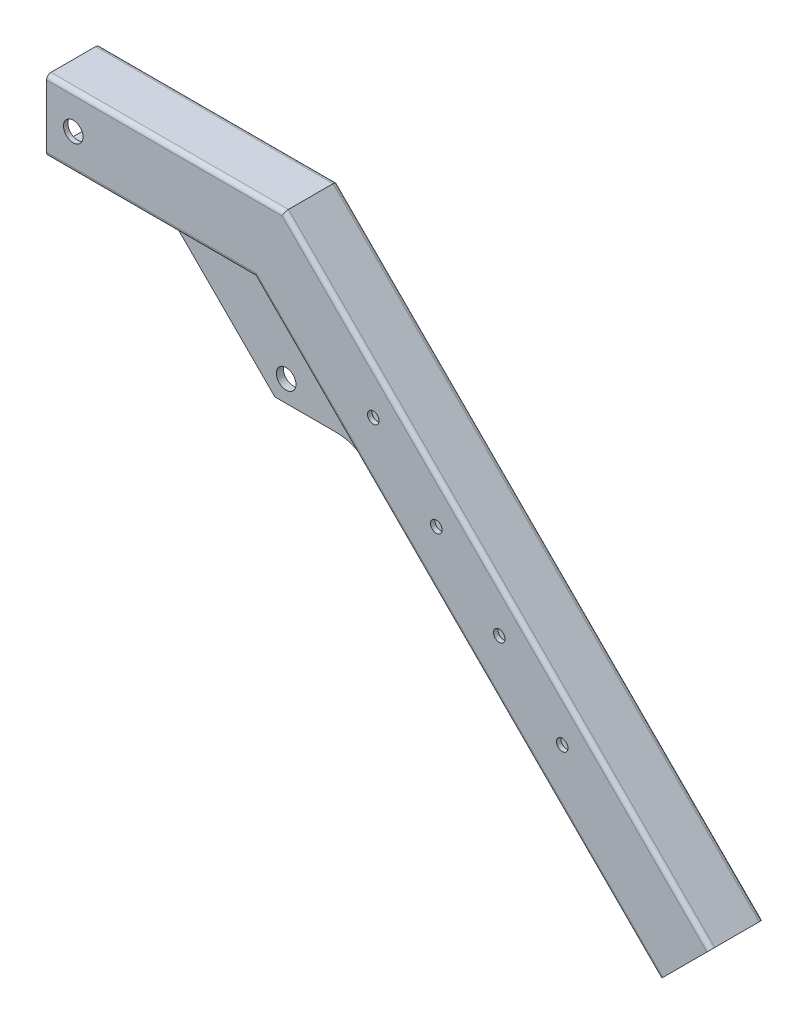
ISO-10303-21;
HEADER;
FILE_DESCRIPTION(('STEP AP214'),'2;1');
FILE_NAME('part.step','',(''),(''),'','','');
FILE_SCHEMA(('AUTOMOTIVE_DESIGN { 1 0 10303 214 1 1 1 1 }'));
ENDSEC;
DATA;
#1=APPLICATION_CONTEXT('core data for automotive mechanical design processes');
#2=APPLICATION_PROTOCOL_DEFINITION('international standard','automotive_design',2000,#1);
#3=PRODUCT_CONTEXT('',#1,'mechanical');
#4=PRODUCT('Part','Part','',(#3));
#5=PRODUCT_RELATED_PRODUCT_CATEGORY('part','',(#4));
#6=PRODUCT_DEFINITION_FORMATION('','',#4);
#7=PRODUCT_DEFINITION_CONTEXT('part definition',#1,'design');
#8=PRODUCT_DEFINITION('design','',#6,#7);
#9=PRODUCT_DEFINITION_SHAPE('','',#8);
#10=(LENGTH_UNIT() NAMED_UNIT(*) SI_UNIT(.MILLI.,.METRE.));
#11=(NAMED_UNIT(*) PLANE_ANGLE_UNIT() SI_UNIT($,.RADIAN.));
#12=(NAMED_UNIT(*) SI_UNIT($,.STERADIAN.) SOLID_ANGLE_UNIT());
#13=UNCERTAINTY_MEASURE_WITH_UNIT(LENGTH_MEASURE(1.E-05),#10,'distance_accuracy_value','');
#14=(GEOMETRIC_REPRESENTATION_CONTEXT(3) GLOBAL_UNCERTAINTY_ASSIGNED_CONTEXT((#13)) GLOBAL_UNIT_ASSIGNED_CONTEXT((#10,
#11,#12)) REPRESENTATION_CONTEXT('',''));
#15=CARTESIAN_POINT('',(0.,0.,0.));
#16=DIRECTION('',(0.,0.,1.));
#17=DIRECTION('',(1.,0.,0.));
#18=AXIS2_PLACEMENT_3D('',#15,#16,#17);
#19=CARTESIAN_POINT('',(195.251262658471,-24.7487373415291,30.));
#20=DIRECTION('',(0.707106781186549,0.707106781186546,0.));
#21=DIRECTION('',(-0.707106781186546,0.707106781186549,0.));
#22=AXIS2_PLACEMENT_3D('',#19,#20,#21);
#23=PLANE('',#22);
#24=DIRECTION('',(0.,0.,-1.));
#25=VECTOR('',#24,1.);
#26=CARTESIAN_POINT('',(661.941738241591,-491.439212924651,30.));
#27=LINE('',#26,#25);
#28=CARTESIAN_POINT('',(661.941738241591,-491.439212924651,25.));
#29=VERTEX_POINT('',#28);
#30=CARTESIAN_POINT('',(661.941738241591,-491.439212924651,22.5));
#31=VERTEX_POINT('',#30);
#32=EDGE_CURVE('E313',#29,#31,#27,.T.);
#33=ORIENTED_EDGE('',*,*,#32,.T.);
#34=DIRECTION('',(0.707106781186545,-0.70710678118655,0.));
#35=VECTOR('',#34,1.);
#36=CARTESIAN_POINT('',(661.941738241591,-491.439212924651,22.5));
#37=LINE('',#36,#35);
#38=CARTESIAN_POINT('',(647.79960261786,-477.29707730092,22.5));
#39=VERTEX_POINT('',#38);
#40=EDGE_CURVE('E471',#39,#31,#37,.T.);
#41=ORIENTED_EDGE('',*,*,#40,.F.);
#42=DIRECTION('',(0.,0.,1.));
#43=VECTOR('',#42,1.);
#44=CARTESIAN_POINT('',(647.79960261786,-477.29707730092,22.5));
#45=LINE('',#44,#43);
#46=CARTESIAN_POINT('',(647.79960261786,-477.29707730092,-22.5));
#47=VERTEX_POINT('',#46);
#48=EDGE_CURVE('E467',#47,#39,#45,.T.);
#49=ORIENTED_EDGE('',*,*,#48,.F.);
#50=DIRECTION('',(-0.707106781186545,0.70710678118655,0.));
#51=VECTOR('',#50,1.);
#52=CARTESIAN_POINT('',(661.941738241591,-491.439212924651,-22.5));
#53=LINE('',#52,#51);
#54=CARTESIAN_POINT('',(661.941738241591,-491.439212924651,-22.5));
#55=VERTEX_POINT('',#54);
#56=EDGE_CURVE('E469',#55,#47,#53,.T.);
#57=ORIENTED_EDGE('',*,*,#56,.F.);
#58=CARTESIAN_POINT('',(661.941738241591,-491.439212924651,-25.));
#59=VERTEX_POINT('',#58);
#60=EDGE_CURVE('E310',#55,#59,#27,.T.);
#61=ORIENTED_EDGE('',*,*,#60,.T.);
#62=DIRECTION('',(-0.707106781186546,0.707106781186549,0.));
#63=VECTOR('',#62,1.);
#64=CARTESIAN_POINT('',(195.251262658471,-24.7487373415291,-25.));
#65=LINE('',#64,#63);
#66=CARTESIAN_POINT('',(205.502525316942,-35.,-25.));
#67=VERTEX_POINT('',#66);
#68=EDGE_CURVE('E324',#59,#67,#65,.T.);
#69=ORIENTED_EDGE('',*,*,#68,.T.);
#70=DIRECTION('',(0.,0.,-1.));
#71=VECTOR('',#70,1.);
#72=CARTESIAN_POINT('',(205.502525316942,-35.,30.));
#73=LINE('',#72,#71);
#74=CARTESIAN_POINT('',(205.502525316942,-35.,25.));
#75=VERTEX_POINT('',#74);
#76=EDGE_CURVE('E302',#75,#67,#73,.T.);
#77=ORIENTED_EDGE('',*,*,#76,.F.);
#78=DIRECTION('',(0.707106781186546,-0.707106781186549,0.));
#79=VECTOR('',#78,1.);
#80=CARTESIAN_POINT('',(661.941738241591,-491.439212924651,25.));
#81=LINE('',#80,#79);
#82=EDGE_CURVE('E330',#75,#29,#81,.T.);
#83=ORIENTED_EDGE('',*,*,#82,.T.);
#84=EDGE_LOOP('',(#33,#41,#49,#57,#61,#69,#77,#83));
#85=FACE_BOUND('',#84,.T.);
#86=ADVANCED_FACE('F28',(#85),#23,.T.);
#87=CARTESIAN_POINT('',(191.715728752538,-28.2842712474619,30.));
#88=DIRECTION('',(0.707106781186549,0.707106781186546,0.));
#89=DIRECTION('',(-0.707106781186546,0.707106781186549,0.));
#90=AXIS2_PLACEMENT_3D('',#87,#88,#89);
#91=PLANE('',#90);
#92=DIRECTION('',(-0.707106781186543,0.707106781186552,0.));
#93=VECTOR('',#92,1.);
#94=CARTESIAN_POINT('',(203.431457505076,-40.,-18.));
#95=LINE('',#94,#93);
#96=CARTESIAN_POINT('',(326.970562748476,-163.539105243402,-18.));
#97=VERTEX_POINT('',#96);
#98=CARTESIAN_POINT('',(203.431457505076,-40.,-18.));
#99=VERTEX_POINT('',#98);
#100=EDGE_CURVE('E384',#97,#99,#95,.T.);
#101=ORIENTED_EDGE('',*,*,#100,.F.);
#102=DIRECTION('',(0.,0.,-1.));
#103=VECTOR('',#102,1.);
#104=CARTESIAN_POINT('',(326.970562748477,-163.539105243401,-25.));
#105=LINE('',#104,#103);
#106=CARTESIAN_POINT('',(326.970562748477,-163.539105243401,-25.));
#107=VERTEX_POINT('',#106);
#108=EDGE_CURVE('E130',#97,#107,#105,.T.);
#109=ORIENTED_EDGE('',*,*,#108,.T.);
#110=DIRECTION('',(0.707106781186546,-0.707106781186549,0.));
#111=VECTOR('',#110,1.);
#112=CARTESIAN_POINT('',(658.406204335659,-494.974746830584,-25.));
#113=LINE('',#112,#111);
#114=CARTESIAN_POINT('',(658.406204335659,-494.974746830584,-25.));
#115=VERTEX_POINT('',#114);
#116=EDGE_CURVE('E202',#107,#115,#113,.T.);
#117=ORIENTED_EDGE('',*,*,#116,.T.);
#118=DIRECTION('',(0.,0.,-1.));
#119=VECTOR('',#118,1.);
#120=CARTESIAN_POINT('',(658.406204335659,-494.974746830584,30.));
#121=LINE('',#120,#119);
#122=CARTESIAN_POINT('',(658.406204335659,-494.974746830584,25.));
#123=VERTEX_POINT('',#122);
#124=EDGE_CURVE('E246',#123,#115,#121,.T.);
#125=ORIENTED_EDGE('',*,*,#124,.F.);
#126=DIRECTION('',(0.707106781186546,-0.707106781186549,0.));
#127=VECTOR('',#126,1.);
#128=CARTESIAN_POINT('',(191.715728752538,-28.2842712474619,25.));
#129=LINE('',#128,#127);
#130=CARTESIAN_POINT('',(326.970562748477,-163.539105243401,25.));
#131=VERTEX_POINT('',#130);
#132=EDGE_CURVE('E199',#123,#131,#129,.F.);
#133=ORIENTED_EDGE('',*,*,#132,.T.);
#134=DIRECTION('',(0.,0.,1.));
#135=VECTOR('',#134,1.);
#136=CARTESIAN_POINT('',(326.970562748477,-163.539105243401,30.));
#137=LINE('',#136,#135);
#138=CARTESIAN_POINT('',(326.970562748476,-163.539105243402,18.));
#139=VERTEX_POINT('',#138);
#140=EDGE_CURVE('E141',#131,#139,#137,.F.);
#141=ORIENTED_EDGE('',*,*,#140,.T.);
#142=DIRECTION('',(-0.707106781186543,0.707106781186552,0.));
#143=VECTOR('',#142,1.);
#144=CARTESIAN_POINT('',(203.431457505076,-40.,18.));
#145=LINE('',#144,#143);
#146=CARTESIAN_POINT('',(203.431457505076,-40.,18.));
#147=VERTEX_POINT('',#146);
#148=EDGE_CURVE('E106',#139,#147,#145,.T.);
#149=ORIENTED_EDGE('',*,*,#148,.T.);
#150=DIRECTION('',(0.,0.,-1.));
#151=VECTOR('',#150,1.);
#152=CARTESIAN_POINT('',(203.431457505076,-40.,30.));
#153=LINE('',#152,#151);
#154=EDGE_CURVE('E261',#147,#99,#153,.T.);
#155=ORIENTED_EDGE('',*,*,#154,.T.);
#156=EDGE_LOOP('',(#101,#109,#117,#125,#133,#141,#149,#155));
#157=FACE_BOUND('',#156,.T.);
#158=ADVANCED_FACE('F30',(#157),#91,.F.);
#159=CARTESIAN_POINT('',(-30.,-40.,30.));
#160=DIRECTION('',(0.,1.,0.));
#161=DIRECTION('',(0.,0.,1.));
#162=AXIS2_PLACEMENT_3D('',#159,#160,#161);
#163=PLANE('',#162);
#164=DIRECTION('',(0.,0.,-1.));
#165=VECTOR('',#164,1.);
#166=CARTESIAN_POINT('',(113.431457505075,-40.,-18.));
#167=LINE('',#166,#165);
#168=CARTESIAN_POINT('',(113.431457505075,-40.,-18.));
#169=VERTEX_POINT('',#168);
#170=CARTESIAN_POINT('',(113.431457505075,-40.,-25.));
#171=VERTEX_POINT('',#170);
#172=EDGE_CURVE('E368',#169,#171,#167,.T.);
#173=ORIENTED_EDGE('',*,*,#172,.F.);
#174=DIRECTION('',(-1.,0.,0.));
#175=VECTOR('',#174,1.);
#176=CARTESIAN_POINT('',(113.431457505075,-40.,-18.));
#177=LINE('',#176,#175);
#178=EDGE_CURVE('E387',#99,#169,#177,.T.);
#179=ORIENTED_EDGE('',*,*,#178,.F.);
#180=ORIENTED_EDGE('',*,*,#154,.F.);
#181=DIRECTION('',(-1.,0.,0.));
#182=VECTOR('',#181,1.);
#183=CARTESIAN_POINT('',(113.431457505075,-40.,18.));
#184=LINE('',#183,#182);
#185=CARTESIAN_POINT('',(113.431457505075,-40.,18.));
#186=VERTEX_POINT('',#185);
#187=EDGE_CURVE('E353',#147,#186,#184,.T.);
#188=ORIENTED_EDGE('',*,*,#187,.T.);
#189=DIRECTION('',(0.,0.,1.));
#190=VECTOR('',#189,1.);
#191=CARTESIAN_POINT('',(113.431457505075,-40.,18.));
#192=LINE('',#191,#190);
#193=CARTESIAN_POINT('',(113.431457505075,-40.,25.));
#194=VERTEX_POINT('',#193);
#195=EDGE_CURVE('E345',#186,#194,#192,.T.);
#196=ORIENTED_EDGE('',*,*,#195,.T.);
#197=DIRECTION('',(1.,0.,0.));
#198=VECTOR('',#197,1.);
#199=CARTESIAN_POINT('',(-30.,-40.,25.));
#200=LINE('',#199,#198);
#201=CARTESIAN_POINT('',(-30.,-40.,25.));
#202=VERTEX_POINT('',#201);
#203=EDGE_CURVE('E230',#194,#202,#200,.F.);
#204=ORIENTED_EDGE('',*,*,#203,.T.);
#205=DIRECTION('',(0.,0.,-1.));
#206=VECTOR('',#205,1.);
#207=CARTESIAN_POINT('',(-30.,-40.,30.));
#208=LINE('',#207,#206);
#209=CARTESIAN_POINT('',(-30.,-40.,-25.));
#210=VERTEX_POINT('',#209);
#211=EDGE_CURVE('E258',#202,#210,#208,.T.);
#212=ORIENTED_EDGE('',*,*,#211,.T.);
#213=DIRECTION('',(1.,0.,0.));
#214=VECTOR('',#213,1.);
#215=CARTESIAN_POINT('',(203.431457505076,-40.,-25.));
#216=LINE('',#215,#214);
#217=EDGE_CURVE('E231',#210,#171,#216,.T.);
#218=ORIENTED_EDGE('',*,*,#217,.T.);
#219=EDGE_LOOP('',(#173,#179,#180,#188,#196,#204,#212,#218));
#220=FACE_BOUND('',#219,.T.);
#221=ADVANCED_FACE('F579',(#220),#163,.F.);
#222=CARTESIAN_POINT('',(-30.,-40.,30.));
#223=DIRECTION('',(-1.,0.,0.));
#224=DIRECTION('',(0.,0.,1.));
#225=AXIS2_PLACEMENT_3D('',#222,#223,#224);
#226=PLANE('',#225);
#227=ORIENTED_EDGE('',*,*,#211,.F.);
#228=CARTESIAN_POINT('',(-30.,-35.,25.));
#229=DIRECTION('',(-1.,0.,0.));
#230=DIRECTION('',(0.,0.,1.));
#231=AXIS2_PLACEMENT_3D('',#228,#229,#230);
#232=CIRCLE('',#231,5.);
#233=CARTESIAN_POINT('',(-30.,-35.,30.));
#234=VERTEX_POINT('',#233);
#235=EDGE_CURVE('E215',#202,#234,#232,.T.);
#236=ORIENTED_EDGE('',*,*,#235,.T.);
#237=DIRECTION('',(0.,1.,0.));
#238=VECTOR('',#237,1.);
#239=CARTESIAN_POINT('',(-30.,-40.,30.));
#240=LINE('',#239,#238);
#241=CARTESIAN_POINT('',(-30.,35.,30.));
#242=VERTEX_POINT('',#241);
#243=EDGE_CURVE('E264',#234,#242,#240,.T.);
#244=ORIENTED_EDGE('',*,*,#243,.T.);
#245=CARTESIAN_POINT('',(-30.,35.,25.));
#246=DIRECTION('',(-1.,0.,0.));
#247=DIRECTION('',(0.,0.,1.));
#248=AXIS2_PLACEMENT_3D('',#245,#246,#247);
#249=CIRCLE('',#248,5.);
#250=CARTESIAN_POINT('',(-30.,40.,25.));
#251=VERTEX_POINT('',#250);
#252=EDGE_CURVE('E224',#242,#251,#249,.T.);
#253=ORIENTED_EDGE('',*,*,#252,.T.);
#254=DIRECTION('',(0.,0.,-1.));
#255=VECTOR('',#254,1.);
#256=CARTESIAN_POINT('',(-30.,40.,30.));
#257=LINE('',#256,#255);
#258=CARTESIAN_POINT('',(-30.,40.,-25.));
#259=VERTEX_POINT('',#258);
#260=EDGE_CURVE('E255',#251,#259,#257,.T.);
#261=ORIENTED_EDGE('',*,*,#260,.T.);
#262=CARTESIAN_POINT('',(-30.,35.,-25.));
#263=DIRECTION('',(-1.,0.,0.));
#264=DIRECTION('',(0.,0.,1.));
#265=AXIS2_PLACEMENT_3D('',#262,#263,#264);
#266=CIRCLE('',#265,5.);
#267=CARTESIAN_POINT('',(-30.,35.,-30.));
#268=VERTEX_POINT('',#267);
#269=EDGE_CURVE('E221',#259,#268,#266,.T.);
#270=ORIENTED_EDGE('',*,*,#269,.T.);
#271=DIRECTION('',(0.,1.,0.));
#272=VECTOR('',#271,1.);
#273=CARTESIAN_POINT('',(-30.,-40.,-30.));
#274=LINE('',#273,#272);
#275=CARTESIAN_POINT('',(-30.,-35.,-30.));
#276=VERTEX_POINT('',#275);
#277=EDGE_CURVE('E270',#276,#268,#274,.T.);
#278=ORIENTED_EDGE('',*,*,#277,.F.);
#279=CARTESIAN_POINT('',(-30.,-35.,-25.));
#280=DIRECTION('',(-1.,0.,0.));
#281=DIRECTION('',(0.,0.,1.));
#282=AXIS2_PLACEMENT_3D('',#279,#280,#281);
#283=CIRCLE('',#282,5.);
#284=EDGE_CURVE('E218',#276,#210,#283,.T.);
#285=ORIENTED_EDGE('',*,*,#284,.T.);
#286=EDGE_LOOP('',(#227,#236,#244,#253,#261,#270,#278,#285));
#287=FACE_BOUND('',#286,.T.);
#288=DIRECTION('',(0.,1.,0.));
#289=VECTOR('',#288,1.);
#290=CARTESIAN_POINT('',(-30.,-494.974746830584,25.));
#291=LINE('',#290,#289);
#292=CARTESIAN_POINT('',(-30.,-35.,25.));
#293=VERTEX_POINT('',#292);
#294=CARTESIAN_POINT('',(-30.,35.,25.));
#295=VERTEX_POINT('',#294);
#296=EDGE_CURVE('E299',#293,#295,#291,.T.);
#297=ORIENTED_EDGE('',*,*,#296,.F.);
#298=DIRECTION('',(0.,0.,-1.));
#299=VECTOR('',#298,1.);
#300=CARTESIAN_POINT('',(-30.,-35.,30.));
#301=LINE('',#300,#299);
#302=CARTESIAN_POINT('',(-30.,-35.,-25.));
#303=VERTEX_POINT('',#302);
#304=EDGE_CURVE('E298',#293,#303,#301,.T.);
#305=ORIENTED_EDGE('',*,*,#304,.T.);
#306=DIRECTION('',(0.,1.,0.));
#307=VECTOR('',#306,1.);
#308=CARTESIAN_POINT('',(-30.,-494.974746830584,-25.));
#309=LINE('',#308,#307);
#310=CARTESIAN_POINT('',(-30.,35.,-25.));
#311=VERTEX_POINT('',#310);
#312=EDGE_CURVE('E289',#303,#311,#309,.T.);
#313=ORIENTED_EDGE('',*,*,#312,.T.);
#314=DIRECTION('',(0.,0.,-1.));
#315=VECTOR('',#314,1.);
#316=CARTESIAN_POINT('',(-30.,35.,30.));
#317=LINE('',#316,#315);
#318=EDGE_CURVE('E294',#295,#311,#317,.T.);
#319=ORIENTED_EDGE('',*,*,#318,.F.);
#320=EDGE_LOOP('',(#297,#305,#313,#319));
#321=FACE_BOUND('',#320,.T.);
#322=ADVANCED_FACE('F659',(#287,#321),#226,.T.);
#323=CARTESIAN_POINT('',(714.974746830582,-438.40620433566,30.));
#324=DIRECTION('',(0.707106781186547,-0.707106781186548,0.));
#325=DIRECTION('',(0.707106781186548,0.707106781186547,0.));
#326=AXIS2_PLACEMENT_3D('',#323,#324,#325);
#327=PLANE('',#326);
#328=DIRECTION('',(-0.707106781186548,-0.707106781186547,0.));
#329=VECTOR('',#328,1.);
#330=CARTESIAN_POINT('',(658.406204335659,-494.974746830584,25.));
#331=LINE('',#330,#329);
#332=CARTESIAN_POINT('',(711.43921292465,-441.941738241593,25.));
#333=VERTEX_POINT('',#332);
#334=EDGE_CURVE('E292',#333,#29,#331,.T.);
#335=ORIENTED_EDGE('',*,*,#334,.F.);
#336=DIRECTION('',(0.,0.,-1.));
#337=VECTOR('',#336,1.);
#338=CARTESIAN_POINT('',(711.43921292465,-441.941738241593,30.));
#339=LINE('',#338,#337);
#340=CARTESIAN_POINT('',(711.43921292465,-441.941738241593,-25.));
#341=VERTEX_POINT('',#340);
#342=EDGE_CURVE('E307',#333,#341,#339,.T.);
#343=ORIENTED_EDGE('',*,*,#342,.T.);
#344=DIRECTION('',(-0.707106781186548,-0.707106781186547,0.));
#345=VECTOR('',#344,1.);
#346=CARTESIAN_POINT('',(658.406204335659,-494.974746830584,-25.));
#347=LINE('',#346,#345);
#348=EDGE_CURVE('E293',#341,#59,#347,.T.);
#349=ORIENTED_EDGE('',*,*,#348,.T.);
#350=ORIENTED_EDGE('',*,*,#60,.F.);
#351=DIRECTION('',(-0.707106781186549,-0.707106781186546,0.));
#352=VECTOR('',#351,1.);
#353=CARTESIAN_POINT('',(669.012806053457,-484.368145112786,-22.5));
#354=LINE('',#353,#352);
#355=CARTESIAN_POINT('',(669.012806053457,-484.368145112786,-22.5));
#356=VERTEX_POINT('',#355);
#357=EDGE_CURVE('E448',#356,#55,#354,.T.);
#358=ORIENTED_EDGE('',*,*,#357,.F.);
#359=DIRECTION('',(0.,0.,-1.));
#360=VECTOR('',#359,1.);
#361=CARTESIAN_POINT('',(669.012806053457,-484.368145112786,22.5));
#362=LINE('',#361,#360);
#363=CARTESIAN_POINT('',(669.012806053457,-484.368145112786,22.5));
#364=VERTEX_POINT('',#363);
#365=EDGE_CURVE('E461',#364,#356,#362,.T.);
#366=ORIENTED_EDGE('',*,*,#365,.F.);
#367=DIRECTION('',(-0.707106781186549,-0.707106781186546,0.));
#368=VECTOR('',#367,1.);
#369=CARTESIAN_POINT('',(669.012806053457,-484.368145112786,22.5));
#370=LINE('',#369,#368);
#371=EDGE_CURVE('E445',#364,#31,#370,.T.);
#372=ORIENTED_EDGE('',*,*,#371,.T.);
#373=ORIENTED_EDGE('',*,*,#32,.F.);
#374=EDGE_LOOP('',(#335,#343,#349,#350,#358,#366,#372,#373));
#375=FACE_BOUND('',#374,.T.);
#376=DIRECTION('',(-0.707106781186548,-0.707106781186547,0.));
#377=VECTOR('',#376,1.);
#378=CARTESIAN_POINT('',(714.974746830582,-438.40620433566,30.));
#379=LINE('',#378,#377);
#380=CARTESIAN_POINT('',(711.43921292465,-441.941738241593,30.));
#381=VERTEX_POINT('',#380);
#382=CARTESIAN_POINT('',(661.941738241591,-491.439212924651,30.));
#383=VERTEX_POINT('',#382);
#384=EDGE_CURVE('E267',#381,#383,#379,.T.);
#385=ORIENTED_EDGE('',*,*,#384,.T.);
#386=CARTESIAN_POINT('',(661.941738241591,-491.439212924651,25.));
#387=DIRECTION('',(0.707106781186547,-0.707106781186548,0.));
#388=DIRECTION('',(0.707106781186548,0.707106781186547,0.));
#389=AXIS2_PLACEMENT_3D('',#386,#387,#388);
#390=CIRCLE('',#389,5.);
#391=EDGE_CURVE('E203',#383,#123,#390,.T.);
#392=ORIENTED_EDGE('',*,*,#391,.T.);
#393=ORIENTED_EDGE('',*,*,#124,.T.);
#394=CARTESIAN_POINT('',(661.941738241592,-491.439212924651,-25.));
#395=DIRECTION('',(0.707106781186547,-0.707106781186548,0.));
#396=DIRECTION('',(0.707106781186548,0.707106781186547,0.));
#397=AXIS2_PLACEMENT_3D('',#394,#395,#396);
#398=CIRCLE('',#397,5.);
#399=CARTESIAN_POINT('',(661.941738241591,-491.439212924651,-30.));
#400=VERTEX_POINT('',#399);
#401=EDGE_CURVE('E206',#115,#400,#398,.T.);
#402=ORIENTED_EDGE('',*,*,#401,.T.);
#403=DIRECTION('',(-0.707106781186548,-0.707106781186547,0.));
#404=VECTOR('',#403,1.);
#405=CARTESIAN_POINT('',(714.974746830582,-438.40620433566,-30.));
#406=LINE('',#405,#404);
#407=CARTESIAN_POINT('',(711.43921292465,-441.941738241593,-30.));
#408=VERTEX_POINT('',#407);
#409=EDGE_CURVE('E273',#408,#400,#406,.T.);
#410=ORIENTED_EDGE('',*,*,#409,.F.);
#411=CARTESIAN_POINT('',(711.43921292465,-441.941738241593,-25.));
#412=DIRECTION('',(0.707106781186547,-0.707106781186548,0.));
#413=DIRECTION('',(0.707106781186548,0.707106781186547,0.));
#414=AXIS2_PLACEMENT_3D('',#411,#412,#413);
#415=CIRCLE('',#414,5.);
#416=CARTESIAN_POINT('',(714.974746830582,-438.40620433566,-25.));
#417=VERTEX_POINT('',#416);
#418=EDGE_CURVE('E209',#408,#417,#415,.T.);
#419=ORIENTED_EDGE('',*,*,#418,.T.);
#420=DIRECTION('',(0.,0.,-1.));
#421=VECTOR('',#420,1.);
#422=CARTESIAN_POINT('',(714.974746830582,-438.40620433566,30.));
#423=LINE('',#422,#421);
#424=CARTESIAN_POINT('',(714.974746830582,-438.40620433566,25.));
#425=VERTEX_POINT('',#424);
#426=EDGE_CURVE('E249',#425,#417,#423,.T.);
#427=ORIENTED_EDGE('',*,*,#426,.F.);
#428=CARTESIAN_POINT('',(711.43921292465,-441.941738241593,25.));
#429=DIRECTION('',(0.707106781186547,-0.707106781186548,0.));
#430=DIRECTION('',(0.707106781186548,0.707106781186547,0.));
#431=AXIS2_PLACEMENT_3D('',#428,#429,#430);
#432=CIRCLE('',#431,5.);
#433=EDGE_CURVE('E212',#425,#381,#432,.T.);
#434=ORIENTED_EDGE('',*,*,#433,.T.);
#435=EDGE_LOOP('',(#385,#392,#393,#402,#410,#419,#427,#434));
#436=FACE_BOUND('',#435,.T.);
#437=ADVANCED_FACE('F492',(#375,#436),#327,.T.);
#438=CARTESIAN_POINT('',(248.284271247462,28.2842712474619,30.));
#439=DIRECTION('',(0.707106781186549,0.707106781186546,0.));
#440=DIRECTION('',(-0.707106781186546,0.707106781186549,0.));
#441=AXIS2_PLACEMENT_3D('',#438,#439,#440);
#442=PLANE('',#441);
#443=ORIENTED_EDGE('',*,*,#426,.T.);
#444=DIRECTION('',(0.707106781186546,-0.707106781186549,0.));
#445=VECTOR('',#444,1.);
#446=CARTESIAN_POINT('',(248.284271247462,28.2842712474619,-25.));
#447=LINE('',#446,#445);
#448=CARTESIAN_POINT('',(236.568542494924,40.,-25.));
#449=VERTEX_POINT('',#448);
#450=EDGE_CURVE('E181',#417,#449,#447,.F.);
#451=ORIENTED_EDGE('',*,*,#450,.T.);
#452=DIRECTION('',(0.,0.,-1.));
#453=VECTOR('',#452,1.);
#454=CARTESIAN_POINT('',(236.568542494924,40.,30.));
#455=LINE('',#454,#453);
#456=CARTESIAN_POINT('',(236.568542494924,40.,25.));
#457=VERTEX_POINT('',#456);
#458=EDGE_CURVE('E252',#457,#449,#455,.T.);
#459=ORIENTED_EDGE('',*,*,#458,.F.);
#460=DIRECTION('',(0.707106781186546,-0.707106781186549,0.));
#461=VECTOR('',#460,1.);
#462=CARTESIAN_POINT('',(714.974746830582,-438.40620433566,25.));
#463=LINE('',#462,#461);
#464=EDGE_CURVE('E184',#457,#425,#463,.T.);
#465=ORIENTED_EDGE('',*,*,#464,.T.);
#466=EDGE_LOOP('',(#443,#451,#459,#465));
#467=FACE_BOUND('',#466,.T.);
#468=ADVANCED_FACE('F850',(#467),#442,.T.);
#469=CARTESIAN_POINT('',(-30.,40.,30.));
#470=DIRECTION('',(0.,1.,0.));
#471=DIRECTION('',(0.,0.,1.));
#472=AXIS2_PLACEMENT_3D('',#469,#470,#471);
#473=PLANE('',#472);
#474=ORIENTED_EDGE('',*,*,#458,.T.);
#475=DIRECTION('',(1.,0.,0.));
#476=VECTOR('',#475,1.);
#477=CARTESIAN_POINT('',(-30.,40.,-25.));
#478=LINE('',#477,#476);
#479=EDGE_CURVE('E143',#449,#259,#478,.F.);
#480=ORIENTED_EDGE('',*,*,#479,.T.);
#481=ORIENTED_EDGE('',*,*,#260,.F.);
#482=DIRECTION('',(1.,0.,0.));
#483=VECTOR('',#482,1.);
#484=CARTESIAN_POINT('',(236.568542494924,40.,25.));
#485=LINE('',#484,#483);
#486=EDGE_CURVE('E147',#251,#457,#485,.T.);
#487=ORIENTED_EDGE('',*,*,#486,.T.);
#488=EDGE_LOOP('',(#474,#480,#481,#487));
#489=FACE_BOUND('',#488,.T.);
#490=ADVANCED_FACE('F948',(#489),#473,.T.);
#491=CARTESIAN_POINT('',(658.406204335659,-494.974746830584,30.));
#492=DIRECTION('',(0.,0.,-1.));
#493=DIRECTION('',(-1.,0.,0.));
#494=AXIS2_PLACEMENT_3D('',#491,#492,#493);
#495=PLANE('',#494);
#496=CARTESIAN_POINT('',(548.953452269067,-321.882384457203,30.));
#497=DIRECTION('',(0.,0.,1.));
#498=DIRECTION('',(1.,0.,0.));
#499=AXIS2_PLACEMENT_3D('',#496,#497,#498);
#500=CIRCLE('',#499,6.50000000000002);
#501=CARTESIAN_POINT('',(555.453452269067,-321.882384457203,30.));
#502=VERTEX_POINT('',#501);
#503=EDGE_CURVE('E442',#502,#502,#500,.T.);
#504=ORIENTED_EDGE('',*,*,#503,.F.);
#505=EDGE_LOOP('',(#504));
#506=FACE_BOUND('',#505,.T.);
#507=CARTESIAN_POINT('',(478.242774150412,-251.171706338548,30.));
#508=DIRECTION('',(0.,0.,1.));
#509=DIRECTION('',(1.,0.,0.));
#510=AXIS2_PLACEMENT_3D('',#507,#508,#509);
#511=CIRCLE('',#510,6.50000000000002);
#512=CARTESIAN_POINT('',(484.742774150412,-251.171706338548,30.));
#513=VERTEX_POINT('',#512);
#514=EDGE_CURVE('E435',#513,#513,#511,.T.);
#515=ORIENTED_EDGE('',*,*,#514,.F.);
#516=EDGE_LOOP('',(#515));
#517=FACE_BOUND('',#516,.T.);
#518=CARTESIAN_POINT('',(407.532096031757,-180.461028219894,30.));
#519=DIRECTION('',(0.,0.,1.));
#520=DIRECTION('',(1.,0.,0.));
#521=AXIS2_PLACEMENT_3D('',#518,#519,#520);
#522=CIRCLE('',#521,6.50000000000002);
#523=CARTESIAN_POINT('',(414.032096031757,-180.461028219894,30.));
#524=VERTEX_POINT('',#523);
#525=EDGE_CURVE('E428',#524,#524,#522,.T.);
#526=ORIENTED_EDGE('',*,*,#525,.F.);
#527=EDGE_LOOP('',(#526));
#528=FACE_BOUND('',#527,.T.);
#529=CARTESIAN_POINT('',(336.821417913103,-109.750350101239,30.));
#530=DIRECTION('',(0.,0.,1.));
#531=DIRECTION('',(1.,0.,0.));
#532=AXIS2_PLACEMENT_3D('',#529,#530,#531);
#533=CIRCLE('',#532,6.50000000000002);
#534=CARTESIAN_POINT('',(343.321417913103,-109.750350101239,30.));
#535=VERTEX_POINT('',#534);
#536=EDGE_CURVE('E421',#535,#535,#533,.T.);
#537=ORIENTED_EDGE('',*,*,#536,.F.);
#538=EDGE_LOOP('',(#537));
#539=FACE_BOUND('',#538,.T.);
#540=CARTESIAN_POINT('',(0.,0.,30.));
#541=DIRECTION('',(0.,0.,1.));
#542=DIRECTION('',(1.,0.,0.));
#543=AXIS2_PLACEMENT_3D('',#540,#541,#542);
#544=CIRCLE('',#543,11.);
#545=CARTESIAN_POINT('',(11.,0.,30.));
#546=VERTEX_POINT('',#545);
#547=EDGE_CURVE('E406',#546,#546,#544,.T.);
#548=ORIENTED_EDGE('',*,*,#547,.F.);
#549=EDGE_LOOP('',(#548));
#550=FACE_BOUND('',#549,.T.);
#551=ORIENTED_EDGE('',*,*,#243,.F.);
#552=DIRECTION('',(1.,0.,0.));
#553=VECTOR('',#552,1.);
#554=CARTESIAN_POINT('',(658.406204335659,-35.,30.));
#555=LINE('',#554,#553);
#556=CARTESIAN_POINT('',(205.502525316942,-35.,30.));
#557=VERTEX_POINT('',#556);
#558=EDGE_CURVE('E234',#234,#557,#555,.T.);
#559=ORIENTED_EDGE('',*,*,#558,.T.);
#560=DIRECTION('',(0.707106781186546,-0.707106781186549,0.));
#561=VECTOR('',#560,1.);
#562=CARTESIAN_POINT('',(661.941738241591,-491.439212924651,30.));
#563=LINE('',#562,#561);
#564=EDGE_CURVE('E237',#557,#383,#563,.T.);
#565=ORIENTED_EDGE('',*,*,#564,.T.);
#566=ORIENTED_EDGE('',*,*,#384,.F.);
#567=DIRECTION('',(0.707106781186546,-0.707106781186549,0.));
#568=VECTOR('',#567,1.);
#569=CARTESIAN_POINT('',(233.033008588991,36.4644660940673,30.));
#570=LINE('',#569,#568);
#571=CARTESIAN_POINT('',(234.497474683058,35.,30.));
#572=VERTEX_POINT('',#571);
#573=EDGE_CURVE('E240',#381,#572,#570,.F.);
#574=ORIENTED_EDGE('',*,*,#573,.T.);
#575=DIRECTION('',(1.,0.,0.));
#576=VECTOR('',#575,1.);
#577=CARTESIAN_POINT('',(-30.,35.,30.));
#578=LINE('',#577,#576);
#579=EDGE_CURVE('E243',#572,#242,#578,.F.);
#580=ORIENTED_EDGE('',*,*,#579,.T.);
#581=EDGE_LOOP('',(#551,#559,#565,#566,#574,#580));
#582=FACE_BOUND('',#581,.T.);
#583=ADVANCED_FACE('F604',(#506,#517,#528,#539,#550,#582),#495,.F.);
#584=CARTESIAN_POINT('',(658.406204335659,-494.974746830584,-30.));
#585=DIRECTION('',(0.,0.,-1.));
#586=DIRECTION('',(-1.,0.,0.));
#587=AXIS2_PLACEMENT_3D('',#584,#585,#586);
#588=PLANE('',#587);
#589=CARTESIAN_POINT('',(548.953452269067,-321.882384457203,-30.));
#590=DIRECTION('',(0.,0.,1.));
#591=DIRECTION('',(1.,0.,0.));
#592=AXIS2_PLACEMENT_3D('',#589,#590,#591);
#593=CIRCLE('',#592,6.50000000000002);
#594=CARTESIAN_POINT('',(555.453452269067,-321.882384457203,-30.));
#595=VERTEX_POINT('',#594);
#596=EDGE_CURVE('E154',#595,#595,#593,.T.);
#597=ORIENTED_EDGE('',*,*,#596,.T.);
#598=EDGE_LOOP('',(#597));
#599=FACE_BOUND('',#598,.T.);
#600=CARTESIAN_POINT('',(478.242774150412,-251.171706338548,-30.));
#601=DIRECTION('',(0.,0.,1.));
#602=DIRECTION('',(1.,0.,0.));
#603=AXIS2_PLACEMENT_3D('',#600,#601,#602);
#604=CIRCLE('',#603,6.50000000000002);
#605=CARTESIAN_POINT('',(484.742774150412,-251.171706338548,-30.));
#606=VERTEX_POINT('',#605);
#607=EDGE_CURVE('E159',#606,#606,#604,.T.);
#608=ORIENTED_EDGE('',*,*,#607,.T.);
#609=EDGE_LOOP('',(#608));
#610=FACE_BOUND('',#609,.T.);
#611=CARTESIAN_POINT('',(407.532096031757,-180.461028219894,-30.));
#612=DIRECTION('',(0.,0.,1.));
#613=DIRECTION('',(1.,0.,0.));
#614=AXIS2_PLACEMENT_3D('',#611,#612,#613);
#615=CIRCLE('',#614,6.50000000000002);
#616=CARTESIAN_POINT('',(414.032096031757,-180.461028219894,-30.));
#617=VERTEX_POINT('',#616);
#618=EDGE_CURVE('E164',#617,#617,#615,.T.);
#619=ORIENTED_EDGE('',*,*,#618,.T.);
#620=EDGE_LOOP('',(#619));
#621=FACE_BOUND('',#620,.T.);
#622=CARTESIAN_POINT('',(336.821417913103,-109.750350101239,-30.));
#623=DIRECTION('',(0.,0.,1.));
#624=DIRECTION('',(1.,0.,0.));
#625=AXIS2_PLACEMENT_3D('',#622,#623,#624);
#626=CIRCLE('',#625,6.50000000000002);
#627=CARTESIAN_POINT('',(343.321417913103,-109.750350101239,-30.));
#628=VERTEX_POINT('',#627);
#629=EDGE_CURVE('E169',#628,#628,#626,.T.);
#630=ORIENTED_EDGE('',*,*,#629,.T.);
#631=EDGE_LOOP('',(#630));
#632=FACE_BOUND('',#631,.T.);
#633=CARTESIAN_POINT('',(0.,0.,-30.));
#634=DIRECTION('',(0.,0.,1.));
#635=DIRECTION('',(1.,0.,0.));
#636=AXIS2_PLACEMENT_3D('',#633,#634,#635);
#637=CIRCLE('',#636,11.);
#638=CARTESIAN_POINT('',(11.,0.,-30.));
#639=VERTEX_POINT('',#638);
#640=EDGE_CURVE('E177',#639,#639,#637,.T.);
#641=ORIENTED_EDGE('',*,*,#640,.T.);
#642=EDGE_LOOP('',(#641));
#643=FACE_BOUND('',#642,.T.);
#644=ORIENTED_EDGE('',*,*,#409,.T.);
#645=DIRECTION('',(0.707106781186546,-0.707106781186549,0.));
#646=VECTOR('',#645,1.);
#647=CARTESIAN_POINT('',(206.966991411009,-36.4644660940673,-30.));
#648=LINE('',#647,#646);
#649=CARTESIAN_POINT('',(205.502525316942,-35.,-30.));
#650=VERTEX_POINT('',#649);
#651=EDGE_CURVE('E187',#400,#650,#648,.F.);
#652=ORIENTED_EDGE('',*,*,#651,.T.);
#653=DIRECTION('',(1.,0.,0.));
#654=VECTOR('',#653,1.);
#655=CARTESIAN_POINT('',(-30.,-35.,-30.));
#656=LINE('',#655,#654);
#657=EDGE_CURVE('E190',#650,#276,#656,.F.);
#658=ORIENTED_EDGE('',*,*,#657,.T.);
#659=ORIENTED_EDGE('',*,*,#277,.T.);
#660=DIRECTION('',(1.,0.,0.));
#661=VECTOR('',#660,1.);
#662=CARTESIAN_POINT('',(658.406204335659,35.,-30.));
#663=LINE('',#662,#661);
#664=CARTESIAN_POINT('',(234.497474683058,35.,-30.));
#665=VERTEX_POINT('',#664);
#666=EDGE_CURVE('E196',#268,#665,#663,.T.);
#667=ORIENTED_EDGE('',*,*,#666,.T.);
#668=DIRECTION('',(0.707106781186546,-0.707106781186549,0.));
#669=VECTOR('',#668,1.);
#670=CARTESIAN_POINT('',(711.43921292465,-441.941738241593,-30.));
#671=LINE('',#670,#669);
#672=EDGE_CURVE('E193',#665,#408,#671,.T.);
#673=ORIENTED_EDGE('',*,*,#672,.T.);
#674=EDGE_LOOP('',(#644,#652,#658,#659,#667,#673));
#675=FACE_BOUND('',#674,.T.);
#676=ADVANCED_FACE('F821',(#599,#610,#621,#632,#643,#675),#588,.T.);
#677=CARTESIAN_POINT('',(661.941738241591,-491.439212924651,25.));
#678=DIRECTION('',(0.707106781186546,-0.707106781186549,0.));
#679=DIRECTION('',(0.707106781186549,0.707106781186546,0.));
#680=AXIS2_PLACEMENT_3D('',#677,#678,#679);
#681=CYLINDRICAL_SURFACE('',#680,5.);
#682=ORIENTED_EDGE('',*,*,#391,.F.);
#683=ORIENTED_EDGE('',*,*,#564,.F.);
#684=CARTESIAN_POINT('',(205.502525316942,-35.,25.));
#685=DIRECTION('',(0.923879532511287,-0.382683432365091,0.));
#686=DIRECTION('',(0.382683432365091,0.923879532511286,0.));
#687=AXIS2_PLACEMENT_3D('',#684,#685,#686);
#688=ELLIPSE('',#687,5.41196100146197,5.);
#689=CARTESIAN_POINT('',(203.431457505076,-40.,25.));
#690=VERTEX_POINT('',#689);
#691=EDGE_CURVE('E276',#690,#557,#688,.F.);
#692=ORIENTED_EDGE('',*,*,#691,.F.);
#693=DIRECTION('',(0.707106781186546,-0.707106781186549,0.));
#694=VECTOR('',#693,1.);
#695=CARTESIAN_POINT('',(658.406204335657,-494.974746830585,25.));
#696=LINE('',#695,#694);
#697=EDGE_CURVE('E43',#131,#690,#696,.F.);
#698=ORIENTED_EDGE('',*,*,#697,.F.);
#699=ORIENTED_EDGE('',*,*,#132,.F.);
#700=EDGE_LOOP('',(#682,#683,#692,#698,#699));
#701=FACE_BOUND('',#700,.T.);
#702=ADVANCED_FACE('F598',(#701),#681,.T.);
#703=CARTESIAN_POINT('',(658.406204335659,-35.,25.));
#704=DIRECTION('',(1.,0.,0.));
#705=DIRECTION('',(0.,0.,-1.));
#706=AXIS2_PLACEMENT_3D('',#703,#704,#705);
#707=CYLINDRICAL_SURFACE('',#706,5.);
#708=ORIENTED_EDGE('',*,*,#235,.F.);
#709=ORIENTED_EDGE('',*,*,#203,.F.);
#710=EDGE_CURVE('E227',#690,#194,#200,.F.);
#711=ORIENTED_EDGE('',*,*,#710,.F.);
#712=ORIENTED_EDGE('',*,*,#691,.T.);
#713=ORIENTED_EDGE('',*,*,#558,.F.);
#714=EDGE_LOOP('',(#708,#709,#711,#712,#713));
#715=FACE_BOUND('',#714,.T.);
#716=ADVANCED_FACE('F607',(#715),#707,.T.);
#717=CARTESIAN_POINT('',(-30.,-35.,-25.));
#718=DIRECTION('',(-1.,0.,0.));
#719=DIRECTION('',(0.,0.,1.));
#720=AXIS2_PLACEMENT_3D('',#717,#718,#719);
#721=CYLINDRICAL_SURFACE('',#720,5.);
#722=ORIENTED_EDGE('',*,*,#284,.F.);
#723=ORIENTED_EDGE('',*,*,#657,.F.);
#724=CARTESIAN_POINT('',(205.502525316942,-35.,-25.));
#725=DIRECTION('',(-0.923879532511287,0.382683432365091,0.));
#726=DIRECTION('',(0.382683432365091,0.923879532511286,0.));
#727=AXIS2_PLACEMENT_3D('',#724,#725,#726);
#728=ELLIPSE('',#727,5.41196100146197,5.);
#729=CARTESIAN_POINT('',(203.431457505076,-40.,-25.));
#730=VERTEX_POINT('',#729);
#731=EDGE_CURVE('E279',#730,#650,#728,.F.);
#732=ORIENTED_EDGE('',*,*,#731,.F.);
#733=DIRECTION('',(-1.,0.,0.));
#734=VECTOR('',#733,1.);
#735=CARTESIAN_POINT('',(-30.,-40.,-25.));
#736=LINE('',#735,#734);
#737=EDGE_CURVE('E365',#171,#730,#736,.F.);
#738=ORIENTED_EDGE('',*,*,#737,.F.);
#739=ORIENTED_EDGE('',*,*,#217,.F.);
#740=EDGE_LOOP('',(#722,#723,#732,#738,#739));
#741=FACE_BOUND('',#740,.T.);
#742=ADVANCED_FACE('F813',(#741),#721,.T.);
#743=CARTESIAN_POINT('',(195.251262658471,-24.7487373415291,-25.));
#744=DIRECTION('',(-0.707106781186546,0.707106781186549,0.));
#745=DIRECTION('',(-0.707106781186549,-0.707106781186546,0.));
#746=AXIS2_PLACEMENT_3D('',#743,#744,#745);
#747=CYLINDRICAL_SURFACE('',#746,5.);
#748=ORIENTED_EDGE('',*,*,#731,.T.);
#749=ORIENTED_EDGE('',*,*,#651,.F.);
#750=ORIENTED_EDGE('',*,*,#401,.F.);
#751=ORIENTED_EDGE('',*,*,#116,.F.);
#752=EDGE_CURVE('E66',#730,#107,#113,.T.);
#753=ORIENTED_EDGE('',*,*,#752,.F.);
#754=EDGE_LOOP('',(#748,#749,#750,#751,#753));
#755=FACE_BOUND('',#754,.T.);
#756=ADVANCED_FACE('F594',(#755),#747,.T.);
#757=CARTESIAN_POINT('',(658.406204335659,35.,-25.));
#758=DIRECTION('',(1.,0.,0.));
#759=DIRECTION('',(0.,0.,-1.));
#760=AXIS2_PLACEMENT_3D('',#757,#758,#759);
#761=CYLINDRICAL_SURFACE('',#760,5.);
#762=ORIENTED_EDGE('',*,*,#269,.F.);
#763=ORIENTED_EDGE('',*,*,#479,.F.);
#764=CARTESIAN_POINT('',(234.497474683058,35.0000000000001,-25.));
#765=DIRECTION('',(0.923879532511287,-0.382683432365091,0.));
#766=DIRECTION('',(0.382683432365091,0.923879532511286,0.));
#767=AXIS2_PLACEMENT_3D('',#764,#765,#766);
#768=ELLIPSE('',#767,5.41196100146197,5.);
#769=EDGE_CURVE('E282',#665,#449,#768,.T.);
#770=ORIENTED_EDGE('',*,*,#769,.F.);
#771=ORIENTED_EDGE('',*,*,#666,.F.);
#772=EDGE_LOOP('',(#762,#763,#770,#771));
#773=FACE_BOUND('',#772,.T.);
#774=ADVANCED_FACE('F812',(#773),#761,.T.);
#775=CARTESIAN_POINT('',(711.43921292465,-441.941738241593,-25.));
#776=DIRECTION('',(0.707106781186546,-0.707106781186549,0.));
#777=DIRECTION('',(0.707106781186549,0.707106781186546,0.));
#778=AXIS2_PLACEMENT_3D('',#775,#776,#777);
#779=CYLINDRICAL_SURFACE('',#778,5.);
#780=ORIENTED_EDGE('',*,*,#769,.T.);
#781=ORIENTED_EDGE('',*,*,#450,.F.);
#782=ORIENTED_EDGE('',*,*,#418,.F.);
#783=ORIENTED_EDGE('',*,*,#672,.F.);
#784=EDGE_LOOP('',(#780,#781,#782,#783));
#785=FACE_BOUND('',#784,.T.);
#786=ADVANCED_FACE('F1011',(#785),#779,.T.);
#787=CARTESIAN_POINT('',(-30.,35.,25.));
#788=DIRECTION('',(-1.,0.,0.));
#789=DIRECTION('',(0.,0.,1.));
#790=AXIS2_PLACEMENT_3D('',#787,#788,#789);
#791=CYLINDRICAL_SURFACE('',#790,5.);
#792=ORIENTED_EDGE('',*,*,#252,.F.);
#793=ORIENTED_EDGE('',*,*,#579,.F.);
#794=CARTESIAN_POINT('',(234.497474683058,35.,25.));
#795=DIRECTION('',(-0.923879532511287,0.382683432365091,0.));
#796=DIRECTION('',(-0.382683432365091,-0.923879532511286,0.));
#797=AXIS2_PLACEMENT_3D('',#794,#795,#796);
#798=ELLIPSE('',#797,5.41196100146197,5.);
#799=EDGE_CURVE('E285',#457,#572,#798,.F.);
#800=ORIENTED_EDGE('',*,*,#799,.F.);
#801=ORIENTED_EDGE('',*,*,#486,.F.);
#802=EDGE_LOOP('',(#792,#793,#800,#801));
#803=FACE_BOUND('',#802,.T.);
#804=ADVANCED_FACE('F1003',(#803),#791,.T.);
#805=CARTESIAN_POINT('',(244.748737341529,24.7487373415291,25.));
#806=DIRECTION('',(-0.707106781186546,0.707106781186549,0.));
#807=DIRECTION('',(-0.707106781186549,-0.707106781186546,0.));
#808=AXIS2_PLACEMENT_3D('',#805,#806,#807);
#809=CYLINDRICAL_SURFACE('',#808,5.);
#810=ORIENTED_EDGE('',*,*,#799,.T.);
#811=ORIENTED_EDGE('',*,*,#573,.F.);
#812=ORIENTED_EDGE('',*,*,#433,.F.);
#813=ORIENTED_EDGE('',*,*,#464,.F.);
#814=EDGE_LOOP('',(#810,#811,#812,#813));
#815=FACE_BOUND('',#814,.T.);
#816=ADVANCED_FACE('F669',(#815),#809,.T.);
#817=CARTESIAN_POINT('',(244.748737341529,24.7487373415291,30.));
#818=DIRECTION('',(0.707106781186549,0.707106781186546,0.));
#819=DIRECTION('',(-0.707106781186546,0.707106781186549,0.));
#820=AXIS2_PLACEMENT_3D('',#817,#818,#819);
#821=PLANE('',#820);
#822=ORIENTED_EDGE('',*,*,#342,.F.);
#823=DIRECTION('',(-0.707106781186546,0.707106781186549,0.));
#824=VECTOR('',#823,1.);
#825=CARTESIAN_POINT('',(244.748737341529,24.7487373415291,25.));
#826=LINE('',#825,#824);
#827=CARTESIAN_POINT('',(234.497474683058,35.,25.));
#828=VERTEX_POINT('',#827);
#829=EDGE_CURVE('E327',#333,#828,#826,.T.);
#830=ORIENTED_EDGE('',*,*,#829,.T.);
#831=DIRECTION('',(0.,0.,-1.));
#832=VECTOR('',#831,1.);
#833=CARTESIAN_POINT('',(234.497474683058,35.,30.));
#834=LINE('',#833,#832);
#835=CARTESIAN_POINT('',(234.497474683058,35.,-25.));
#836=VERTEX_POINT('',#835);
#837=EDGE_CURVE('E297',#828,#836,#834,.T.);
#838=ORIENTED_EDGE('',*,*,#837,.T.);
#839=DIRECTION('',(-0.707106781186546,0.707106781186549,0.));
#840=VECTOR('',#839,1.);
#841=CARTESIAN_POINT('',(244.748737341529,24.7487373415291,-25.));
#842=LINE('',#841,#840);
#843=EDGE_CURVE('E319',#341,#836,#842,.T.);
#844=ORIENTED_EDGE('',*,*,#843,.F.);
#845=EDGE_LOOP('',(#822,#830,#838,#844));
#846=FACE_BOUND('',#845,.T.);
#847=ADVANCED_FACE('F646',(#846),#821,.F.);
#848=CARTESIAN_POINT('',(-30.,35.,30.));
#849=DIRECTION('',(0.,1.,0.));
#850=DIRECTION('',(0.,0.,1.));
#851=AXIS2_PLACEMENT_3D('',#848,#849,#850);
#852=PLANE('',#851);
#853=ORIENTED_EDGE('',*,*,#837,.F.);
#854=DIRECTION('',(-1.,0.,0.));
#855=VECTOR('',#854,1.);
#856=CARTESIAN_POINT('',(-30.,35.,25.));
#857=LINE('',#856,#855);
#858=EDGE_CURVE('E316',#828,#295,#857,.T.);
#859=ORIENTED_EDGE('',*,*,#858,.T.);
#860=ORIENTED_EDGE('',*,*,#318,.T.);
#861=DIRECTION('',(-1.,0.,0.));
#862=VECTOR('',#861,1.);
#863=CARTESIAN_POINT('',(-30.,35.,-25.));
#864=LINE('',#863,#862);
#865=EDGE_CURVE('E288',#836,#311,#864,.T.);
#866=ORIENTED_EDGE('',*,*,#865,.F.);
#867=EDGE_LOOP('',(#853,#859,#860,#866));
#868=FACE_BOUND('',#867,.T.);
#869=ADVANCED_FACE('F661',(#868),#852,.F.);
#870=CARTESIAN_POINT('',(-30.,-35.,30.));
#871=DIRECTION('',(0.,1.,0.));
#872=DIRECTION('',(0.,0.,1.));
#873=AXIS2_PLACEMENT_3D('',#870,#871,#872);
#874=PLANE('',#873);
#875=ORIENTED_EDGE('',*,*,#76,.T.);
#876=DIRECTION('',(-1.,0.,0.));
#877=VECTOR('',#876,1.);
#878=CARTESIAN_POINT('',(-30.,-35.,-25.));
#879=LINE('',#878,#877);
#880=EDGE_CURVE('E331',#67,#303,#879,.T.);
#881=ORIENTED_EDGE('',*,*,#880,.T.);
#882=ORIENTED_EDGE('',*,*,#304,.F.);
#883=DIRECTION('',(-1.,0.,0.));
#884=VECTOR('',#883,1.);
#885=CARTESIAN_POINT('',(-30.,-35.,25.));
#886=LINE('',#885,#884);
#887=EDGE_CURVE('E334',#75,#293,#886,.T.);
#888=ORIENTED_EDGE('',*,*,#887,.F.);
#889=EDGE_LOOP('',(#875,#881,#882,#888));
#890=FACE_BOUND('',#889,.T.);
#891=ADVANCED_FACE('F654',(#890),#874,.T.);
#892=CARTESIAN_POINT('',(658.406204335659,-494.974746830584,25.));
#893=DIRECTION('',(0.,0.,-1.));
#894=DIRECTION('',(-1.,0.,0.));
#895=AXIS2_PLACEMENT_3D('',#892,#893,#894);
#896=PLANE('',#895);
#897=CARTESIAN_POINT('',(548.953452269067,-321.882384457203,25.));
#898=DIRECTION('',(0.,0.,-1.));
#899=DIRECTION('',(-1.,0.,0.));
#900=AXIS2_PLACEMENT_3D('',#897,#898,#899);
#901=CIRCLE('',#900,6.50000000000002);
#902=CARTESIAN_POINT('',(542.453452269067,-321.882384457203,25.));
#903=VERTEX_POINT('',#902);
#904=EDGE_CURVE('E153',#903,#903,#901,.T.);
#905=ORIENTED_EDGE('',*,*,#904,.F.);
#906=EDGE_LOOP('',(#905));
#907=FACE_BOUND('',#906,.T.);
#908=CARTESIAN_POINT('',(478.242774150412,-251.171706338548,25.));
#909=DIRECTION('',(0.,0.,-1.));
#910=DIRECTION('',(-1.,0.,0.));
#911=AXIS2_PLACEMENT_3D('',#908,#909,#910);
#912=CIRCLE('',#911,6.50000000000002);
#913=CARTESIAN_POINT('',(471.742774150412,-251.171706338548,25.));
#914=VERTEX_POINT('',#913);
#915=EDGE_CURVE('E158',#914,#914,#912,.T.);
#916=ORIENTED_EDGE('',*,*,#915,.F.);
#917=EDGE_LOOP('',(#916));
#918=FACE_BOUND('',#917,.T.);
#919=CARTESIAN_POINT('',(407.532096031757,-180.461028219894,25.));
#920=DIRECTION('',(0.,0.,-1.));
#921=DIRECTION('',(-1.,0.,0.));
#922=AXIS2_PLACEMENT_3D('',#919,#920,#921);
#923=CIRCLE('',#922,6.50000000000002);
#924=CARTESIAN_POINT('',(401.032096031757,-180.461028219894,25.));
#925=VERTEX_POINT('',#924);
#926=EDGE_CURVE('E163',#925,#925,#923,.T.);
#927=ORIENTED_EDGE('',*,*,#926,.F.);
#928=EDGE_LOOP('',(#927));
#929=FACE_BOUND('',#928,.T.);
#930=CARTESIAN_POINT('',(336.821417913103,-109.750350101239,25.));
#931=DIRECTION('',(0.,0.,-1.));
#932=DIRECTION('',(-1.,0.,0.));
#933=AXIS2_PLACEMENT_3D('',#930,#931,#932);
#934=CIRCLE('',#933,6.50000000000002);
#935=CARTESIAN_POINT('',(330.321417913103,-109.750350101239,25.));
#936=VERTEX_POINT('',#935);
#937=EDGE_CURVE('E168',#936,#936,#934,.T.);
#938=ORIENTED_EDGE('',*,*,#937,.F.);
#939=EDGE_LOOP('',(#938));
#940=FACE_BOUND('',#939,.T.);
#941=CARTESIAN_POINT('',(0.,0.,25.));
#942=DIRECTION('',(0.,0.,-1.));
#943=DIRECTION('',(-1.,0.,0.));
#944=AXIS2_PLACEMENT_3D('',#941,#942,#943);
#945=CIRCLE('',#944,11.);
#946=CARTESIAN_POINT('',(-11.,0.,25.));
#947=VERTEX_POINT('',#946);
#948=EDGE_CURVE('E176',#947,#947,#945,.T.);
#949=ORIENTED_EDGE('',*,*,#948,.F.);
#950=EDGE_LOOP('',(#949));
#951=FACE_BOUND('',#950,.T.);
#952=ORIENTED_EDGE('',*,*,#296,.T.);
#953=ORIENTED_EDGE('',*,*,#858,.F.);
#954=ORIENTED_EDGE('',*,*,#829,.F.);
#955=ORIENTED_EDGE('',*,*,#334,.T.);
#956=ORIENTED_EDGE('',*,*,#82,.F.);
#957=ORIENTED_EDGE('',*,*,#887,.T.);
#958=EDGE_LOOP('',(#952,#953,#954,#955,#956,#957));
#959=FACE_BOUND('',#958,.T.);
#960=ADVANCED_FACE('F642',(#907,#918,#929,#940,#951,#959),#896,.T.);
#961=CARTESIAN_POINT('',(658.406204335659,-494.974746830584,-25.));
#962=DIRECTION('',(0.,0.,-1.));
#963=DIRECTION('',(-1.,0.,0.));
#964=AXIS2_PLACEMENT_3D('',#961,#962,#963);
#965=PLANE('',#964);
#966=CARTESIAN_POINT('',(548.953452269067,-321.882384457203,-25.));
#967=DIRECTION('',(0.,0.,-1.));
#968=DIRECTION('',(-1.,0.,0.));
#969=AXIS2_PLACEMENT_3D('',#966,#967,#968);
#970=CIRCLE('',#969,6.50000000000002);
#971=CARTESIAN_POINT('',(542.453452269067,-321.882384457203,-25.));
#972=VERTEX_POINT('',#971);
#973=EDGE_CURVE('E150',#972,#972,#970,.T.);
#974=ORIENTED_EDGE('',*,*,#973,.T.);
#975=EDGE_LOOP('',(#974));
#976=FACE_BOUND('',#975,.T.);
#977=CARTESIAN_POINT('',(478.242774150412,-251.171706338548,-25.));
#978=DIRECTION('',(0.,0.,-1.));
#979=DIRECTION('',(-1.,0.,0.));
#980=AXIS2_PLACEMENT_3D('',#977,#978,#979);
#981=CIRCLE('',#980,6.50000000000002);
#982=CARTESIAN_POINT('',(471.742774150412,-251.171706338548,-25.));
#983=VERTEX_POINT('',#982);
#984=EDGE_CURVE('E155',#983,#983,#981,.T.);
#985=ORIENTED_EDGE('',*,*,#984,.T.);
#986=EDGE_LOOP('',(#985));
#987=FACE_BOUND('',#986,.T.);
#988=CARTESIAN_POINT('',(407.532096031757,-180.461028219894,-25.));
#989=DIRECTION('',(0.,0.,-1.));
#990=DIRECTION('',(-1.,0.,0.));
#991=AXIS2_PLACEMENT_3D('',#988,#989,#990);
#992=CIRCLE('',#991,6.50000000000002);
#993=CARTESIAN_POINT('',(401.032096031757,-180.461028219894,-25.));
#994=VERTEX_POINT('',#993);
#995=EDGE_CURVE('E160',#994,#994,#992,.T.);
#996=ORIENTED_EDGE('',*,*,#995,.T.);
#997=EDGE_LOOP('',(#996));
#998=FACE_BOUND('',#997,.T.);
#999=CARTESIAN_POINT('',(336.821417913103,-109.750350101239,-25.));
#1000=DIRECTION('',(0.,0.,-1.));
#1001=DIRECTION('',(-1.,0.,0.));
#1002=AXIS2_PLACEMENT_3D('',#999,#1000,#1001);
#1003=CIRCLE('',#1002,6.50000000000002);
#1004=CARTESIAN_POINT('',(330.321417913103,-109.750350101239,-25.));
#1005=VERTEX_POINT('',#1004);
#1006=EDGE_CURVE('E165',#1005,#1005,#1003,.T.);
#1007=ORIENTED_EDGE('',*,*,#1006,.T.);
#1008=EDGE_LOOP('',(#1007));
#1009=FACE_BOUND('',#1008,.T.);
#1010=CARTESIAN_POINT('',(0.,0.,-25.));
#1011=DIRECTION('',(0.,0.,-1.));
#1012=DIRECTION('',(-1.,0.,0.));
#1013=AXIS2_PLACEMENT_3D('',#1010,#1011,#1012);
#1014=CIRCLE('',#1013,11.);
#1015=CARTESIAN_POINT('',(-11.,0.,-25.));
#1016=VERTEX_POINT('',#1015);
#1017=EDGE_CURVE('E174',#1016,#1016,#1014,.T.);
#1018=ORIENTED_EDGE('',*,*,#1017,.T.);
#1019=EDGE_LOOP('',(#1018));
#1020=FACE_BOUND('',#1019,.T.);
#1021=ORIENTED_EDGE('',*,*,#348,.F.);
#1022=ORIENTED_EDGE('',*,*,#843,.T.);
#1023=ORIENTED_EDGE('',*,*,#865,.T.);
#1024=ORIENTED_EDGE('',*,*,#312,.F.);
#1025=ORIENTED_EDGE('',*,*,#880,.F.);
#1026=ORIENTED_EDGE('',*,*,#68,.F.);
#1027=EDGE_LOOP('',(#1021,#1022,#1023,#1024,#1025,#1026));
#1028=FACE_BOUND('',#1027,.T.);
#1029=ADVANCED_FACE('F649',(#976,#987,#998,#1009,#1020,#1028),#965,.F.);
#1030=CARTESIAN_POINT('',(113.431457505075,-40.,18.));
#1031=DIRECTION('',(0.,1.,0.));
#1032=DIRECTION('',(0.,0.,1.));
#1033=AXIS2_PLACEMENT_3D('',#1030,#1031,#1032);
#1034=PLANE('',#1033);
#1035=DIRECTION('',(0.,0.,1.));
#1036=VECTOR('',#1035,1.);
#1037=CARTESIAN_POINT('',(203.431457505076,-40.,18.));
#1038=LINE('',#1037,#1036);
#1039=CARTESIAN_POINT('',(203.431457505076,-40.,26.));
#1040=VERTEX_POINT('',#1039);
#1041=EDGE_CURVE('E344',#690,#1040,#1038,.T.);
#1042=ORIENTED_EDGE('',*,*,#1041,.F.);
#1043=ORIENTED_EDGE('',*,*,#710,.T.);
#1044=CARTESIAN_POINT('',(113.431457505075,-40.,26.));
#1045=VERTEX_POINT('',#1044);
#1046=EDGE_CURVE('E348',#194,#1045,#192,.T.);
#1047=ORIENTED_EDGE('',*,*,#1046,.T.);
#1048=DIRECTION('',(-1.,0.,0.));
#1049=VECTOR('',#1048,1.);
#1050=CARTESIAN_POINT('',(113.431457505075,-40.,26.));
#1051=LINE('',#1050,#1049);
#1052=EDGE_CURVE('E362',#1040,#1045,#1051,.T.);
#1053=ORIENTED_EDGE('',*,*,#1052,.F.);
#1054=EDGE_LOOP('',(#1042,#1043,#1047,#1053));
#1055=FACE_BOUND('',#1054,.T.);
#1056=ADVANCED_FACE('F611',(#1055),#1034,.T.);
#1057=CARTESIAN_POINT('',(203.431457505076,-40.,18.));
#1058=DIRECTION('',(0.707106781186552,0.707106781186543,0.));
#1059=DIRECTION('',(-0.707106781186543,0.707106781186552,0.));
#1060=AXIS2_PLACEMENT_3D('',#1057,#1058,#1059);
#1061=PLANE('',#1060);
#1062=DIRECTION('',(-0.707106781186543,0.707106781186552,0.));
#1063=VECTOR('',#1062,1.);
#1064=CARTESIAN_POINT('',(203.431457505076,-40.,26.));
#1065=LINE('',#1064,#1063);
#1066=CARTESIAN_POINT('',(326.970562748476,-163.539105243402,26.));
#1067=VERTEX_POINT('',#1066);
#1068=EDGE_CURVE('E52',#1067,#1040,#1065,.T.);
#1069=ORIENTED_EDGE('',*,*,#1068,.F.);
#1070=DIRECTION('',(0.,0.,1.));
#1071=VECTOR('',#1070,1.);
#1072=CARTESIAN_POINT('',(326.970562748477,-163.539105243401,25.5));
#1073=LINE('',#1072,#1071);
#1074=EDGE_CURVE('E36',#1067,#131,#1073,.F.);
#1075=ORIENTED_EDGE('',*,*,#1074,.T.);
#1076=ORIENTED_EDGE('',*,*,#697,.T.);
#1077=ORIENTED_EDGE('',*,*,#1041,.T.);
#1078=EDGE_LOOP('',(#1069,#1075,#1076,#1077));
#1079=FACE_BOUND('',#1078,.T.);
#1080=ADVANCED_FACE('F138',(#1079),#1061,.T.);
#1081=CARTESIAN_POINT('',(222.325901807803,-148.894444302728,18.));
#1082=DIRECTION('',(0.,-1.,0.));
#1083=DIRECTION('',(0.,0.,-1.));
#1084=AXIS2_PLACEMENT_3D('',#1081,#1082,#1083);
#1085=PLANE('',#1084);
#1086=DIRECTION('',(1.,0.,0.));
#1087=VECTOR('',#1086,1.);
#1088=CARTESIAN_POINT('',(222.325901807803,-148.894444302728,18.));
#1089=LINE('',#1088,#1087);
#1090=CARTESIAN_POINT('',(222.325901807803,-148.894444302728,18.));
#1091=VERTEX_POINT('',#1090);
#1092=CARTESIAN_POINT('',(291.615223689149,-148.894444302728,18.));
#1093=VERTEX_POINT('',#1092);
#1094=EDGE_CURVE('E103',#1091,#1093,#1089,.T.);
#1095=ORIENTED_EDGE('',*,*,#1094,.T.);
#1096=DIRECTION('',(0.,0.,1.));
#1097=VECTOR('',#1096,1.);
#1098=CARTESIAN_POINT('',(291.615223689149,-148.894444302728,18.));
#1099=LINE('',#1098,#1097);
#1100=CARTESIAN_POINT('',(291.615223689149,-148.894444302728,26.));
#1101=VERTEX_POINT('',#1100);
#1102=EDGE_CURVE('E116',#1093,#1101,#1099,.T.);
#1103=ORIENTED_EDGE('',*,*,#1102,.T.);
#1104=DIRECTION('',(1.,0.,0.));
#1105=VECTOR('',#1104,1.);
#1106=CARTESIAN_POINT('',(222.325901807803,-148.894444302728,26.));
#1107=LINE('',#1106,#1105);
#1108=CARTESIAN_POINT('',(222.325901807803,-148.894444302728,26.));
#1109=VERTEX_POINT('',#1108);
#1110=EDGE_CURVE('E357',#1109,#1101,#1107,.T.);
#1111=ORIENTED_EDGE('',*,*,#1110,.F.);
#1112=DIRECTION('',(0.,0.,1.));
#1113=VECTOR('',#1112,1.);
#1114=CARTESIAN_POINT('',(222.325901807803,-148.894444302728,18.));
#1115=LINE('',#1114,#1113);
#1116=EDGE_CURVE('E119',#1091,#1109,#1115,.T.);
#1117=ORIENTED_EDGE('',*,*,#1116,.F.);
#1118=EDGE_LOOP('',(#1095,#1103,#1111,#1117));
#1119=FACE_BOUND('',#1118,.T.);
#1120=ADVANCED_FACE('F114',(#1119),#1085,.T.);
#1121=CARTESIAN_POINT('',(113.431457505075,-40.,18.));
#1122=DIRECTION('',(-0.707106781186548,-0.707106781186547,0.));
#1123=DIRECTION('',(0.707106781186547,-0.707106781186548,0.));
#1124=AXIS2_PLACEMENT_3D('',#1121,#1122,#1123);
#1125=PLANE('',#1124);
#1126=DIRECTION('',(0.707106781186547,-0.707106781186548,0.));
#1127=VECTOR('',#1126,1.);
#1128=CARTESIAN_POINT('',(113.431457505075,-40.,26.));
#1129=LINE('',#1128,#1127);
#1130=EDGE_CURVE('E359',#1045,#1109,#1129,.T.);
#1131=ORIENTED_EDGE('',*,*,#1130,.F.);
#1132=ORIENTED_EDGE('',*,*,#1046,.F.);
#1133=ORIENTED_EDGE('',*,*,#195,.F.);
#1134=DIRECTION('',(0.707106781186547,-0.707106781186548,0.));
#1135=VECTOR('',#1134,1.);
#1136=CARTESIAN_POINT('',(113.431457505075,-40.,18.));
#1137=LINE('',#1136,#1135);
#1138=EDGE_CURVE('E120',#186,#1091,#1137,.T.);
#1139=ORIENTED_EDGE('',*,*,#1138,.T.);
#1140=ORIENTED_EDGE('',*,*,#1116,.T.);
#1141=EDGE_LOOP('',(#1131,#1132,#1133,#1139,#1140));
#1142=FACE_BOUND('',#1141,.T.);
#1143=ADVANCED_FACE('F617',(#1142),#1125,.T.);
#1144=CARTESIAN_POINT('',(203.431457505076,-40.,18.));
#1145=DIRECTION('',(0.,0.,-1.));
#1146=DIRECTION('',(-1.,0.,0.));
#1147=AXIS2_PLACEMENT_3D('',#1144,#1145,#1146);
#1148=PLANE('',#1147);
#1149=CARTESIAN_POINT('',(235.,-125.,18.));
#1150=DIRECTION('',(0.,0.,-1.));
#1151=DIRECTION('',(-1.,0.,0.));
#1152=AXIS2_PLACEMENT_3D('',#1149,#1150,#1151);
#1153=CIRCLE('',#1152,11.);
#1154=CARTESIAN_POINT('',(224.,-125.,18.));
#1155=VERTEX_POINT('',#1154);
#1156=EDGE_CURVE('E409',#1155,#1155,#1153,.T.);
#1157=ORIENTED_EDGE('',*,*,#1156,.F.);
#1158=EDGE_LOOP('',(#1157));
#1159=FACE_BOUND('',#1158,.T.);
#1160=ORIENTED_EDGE('',*,*,#187,.F.);
#1161=ORIENTED_EDGE('',*,*,#148,.F.);
#1162=CARTESIAN_POINT('',(291.615223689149,-198.894444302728,18.));
#1163=DIRECTION('',(0.,0.,-1.));
#1164=DIRECTION('',(-1.,0.,0.));
#1165=AXIS2_PLACEMENT_3D('',#1162,#1163,#1164);
#1166=CIRCLE('',#1165,50.);
#1167=EDGE_CURVE('E11',#139,#1093,#1166,.F.);
#1168=ORIENTED_EDGE('',*,*,#1167,.T.);
#1169=ORIENTED_EDGE('',*,*,#1094,.F.);
#1170=ORIENTED_EDGE('',*,*,#1138,.F.);
#1171=EDGE_LOOP('',(#1160,#1161,#1168,#1169,#1170));
#1172=FACE_BOUND('',#1171,.T.);
#1173=ADVANCED_FACE('F100',(#1159,#1172),#1148,.T.);
#1174=CARTESIAN_POINT('',(203.431457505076,-40.,26.));
#1175=DIRECTION('',(0.,0.,-1.));
#1176=DIRECTION('',(-1.,0.,0.));
#1177=AXIS2_PLACEMENT_3D('',#1174,#1175,#1176);
#1178=PLANE('',#1177);
#1179=CARTESIAN_POINT('',(235.,-125.,26.));
#1180=DIRECTION('',(0.,0.,-1.));
#1181=DIRECTION('',(-1.,0.,0.));
#1182=AXIS2_PLACEMENT_3D('',#1179,#1180,#1181);
#1183=CIRCLE('',#1182,11.);
#1184=CARTESIAN_POINT('',(224.,-125.,26.));
#1185=VERTEX_POINT('',#1184);
#1186=EDGE_CURVE('E412',#1185,#1185,#1183,.T.);
#1187=ORIENTED_EDGE('',*,*,#1186,.T.);
#1188=EDGE_LOOP('',(#1187));
#1189=FACE_BOUND('',#1188,.T.);
#1190=ORIENTED_EDGE('',*,*,#1052,.T.);
#1191=ORIENTED_EDGE('',*,*,#1130,.T.);
#1192=ORIENTED_EDGE('',*,*,#1110,.T.);
#1193=CARTESIAN_POINT('',(291.615223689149,-198.894444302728,26.));
#1194=DIRECTION('',(0.,0.,-1.));
#1195=DIRECTION('',(-1.,0.,0.));
#1196=AXIS2_PLACEMENT_3D('',#1193,#1194,#1195);
#1197=CIRCLE('',#1196,50.);
#1198=EDGE_CURVE('E124',#1101,#1067,#1197,.T.);
#1199=ORIENTED_EDGE('',*,*,#1198,.T.);
#1200=ORIENTED_EDGE('',*,*,#1068,.T.);
#1201=EDGE_LOOP('',(#1190,#1191,#1192,#1199,#1200));
#1202=FACE_BOUND('',#1201,.T.);
#1203=ADVANCED_FACE('F622',(#1189,#1202),#1178,.F.);
#1204=CARTESIAN_POINT('',(113.431457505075,-40.,-18.));
#1205=DIRECTION('',(0.,-1.,0.));
#1206=DIRECTION('',(0.,0.,-1.));
#1207=AXIS2_PLACEMENT_3D('',#1204,#1205,#1206);
#1208=PLANE('',#1207);
#1209=CARTESIAN_POINT('',(113.431457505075,-40.,-26.));
#1210=VERTEX_POINT('',#1209);
#1211=EDGE_CURVE('E376',#171,#1210,#167,.T.);
#1212=ORIENTED_EDGE('',*,*,#1211,.F.);
#1213=ORIENTED_EDGE('',*,*,#737,.T.);
#1214=DIRECTION('',(0.,0.,-1.));
#1215=VECTOR('',#1214,1.);
#1216=CARTESIAN_POINT('',(203.431457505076,-40.,-18.));
#1217=LINE('',#1216,#1215);
#1218=CARTESIAN_POINT('',(203.431457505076,-40.,-26.));
#1219=VERTEX_POINT('',#1218);
#1220=EDGE_CURVE('E369',#730,#1219,#1217,.T.);
#1221=ORIENTED_EDGE('',*,*,#1220,.T.);
#1222=DIRECTION('',(-1.,0.,0.));
#1223=VECTOR('',#1222,1.);
#1224=CARTESIAN_POINT('',(113.431457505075,-40.,-26.));
#1225=LINE('',#1224,#1223);
#1226=EDGE_CURVE('E399',#1219,#1210,#1225,.T.);
#1227=ORIENTED_EDGE('',*,*,#1226,.T.);
#1228=EDGE_LOOP('',(#1212,#1213,#1221,#1227));
#1229=FACE_BOUND('',#1228,.T.);
#1230=ADVANCED_FACE('F692',(#1229),#1208,.F.);
#1231=CARTESIAN_POINT('',(203.431457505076,-40.,-18.));
#1232=DIRECTION('',(-0.707106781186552,-0.707106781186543,0.));
#1233=DIRECTION('',(0.707106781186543,-0.707106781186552,0.));
#1234=AXIS2_PLACEMENT_3D('',#1231,#1232,#1233);
#1235=PLANE('',#1234);
#1236=ORIENTED_EDGE('',*,*,#1220,.F.);
#1237=ORIENTED_EDGE('',*,*,#752,.T.);
#1238=DIRECTION('',(0.,0.,1.));
#1239=VECTOR('',#1238,1.);
#1240=CARTESIAN_POINT('',(326.970562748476,-163.539105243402,-25.5));
#1241=LINE('',#1240,#1239);
#1242=CARTESIAN_POINT('',(326.970562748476,-163.539105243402,-26.));
#1243=VERTEX_POINT('',#1242);
#1244=EDGE_CURVE('E125',#107,#1243,#1241,.F.);
#1245=ORIENTED_EDGE('',*,*,#1244,.T.);
#1246=DIRECTION('',(-0.707106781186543,0.707106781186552,0.));
#1247=VECTOR('',#1246,1.);
#1248=CARTESIAN_POINT('',(203.431457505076,-40.,-26.));
#1249=LINE('',#1248,#1247);
#1250=EDGE_CURVE('E396',#1243,#1219,#1249,.T.);
#1251=ORIENTED_EDGE('',*,*,#1250,.T.);
#1252=EDGE_LOOP('',(#1236,#1237,#1245,#1251));
#1253=FACE_BOUND('',#1252,.T.);
#1254=ADVANCED_FACE('F696',(#1253),#1235,.F.);
#1255=CARTESIAN_POINT('',(113.431457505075,-40.,-18.));
#1256=DIRECTION('',(0.707106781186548,0.707106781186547,0.));
#1257=DIRECTION('',(-0.707106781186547,0.707106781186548,0.));
#1258=AXIS2_PLACEMENT_3D('',#1255,#1256,#1257);
#1259=PLANE('',#1258);
#1260=DIRECTION('',(0.707106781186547,-0.707106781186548,0.));
#1261=VECTOR('',#1260,1.);
#1262=CARTESIAN_POINT('',(113.431457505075,-40.,-26.));
#1263=LINE('',#1262,#1261);
#1264=CARTESIAN_POINT('',(222.325901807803,-148.894444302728,-26.));
#1265=VERTEX_POINT('',#1264);
#1266=EDGE_CURVE('E390',#1210,#1265,#1263,.T.);
#1267=ORIENTED_EDGE('',*,*,#1266,.T.);
#1268=DIRECTION('',(0.,0.,-1.));
#1269=VECTOR('',#1268,1.);
#1270=CARTESIAN_POINT('',(222.325901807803,-148.894444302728,-18.));
#1271=LINE('',#1270,#1269);
#1272=CARTESIAN_POINT('',(222.325901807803,-148.894444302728,-18.));
#1273=VERTEX_POINT('',#1272);
#1274=EDGE_CURVE('E372',#1273,#1265,#1271,.T.);
#1275=ORIENTED_EDGE('',*,*,#1274,.F.);
#1276=DIRECTION('',(0.707106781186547,-0.707106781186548,0.));
#1277=VECTOR('',#1276,1.);
#1278=CARTESIAN_POINT('',(113.431457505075,-40.,-18.));
#1279=LINE('',#1278,#1277);
#1280=EDGE_CURVE('E373',#169,#1273,#1279,.T.);
#1281=ORIENTED_EDGE('',*,*,#1280,.F.);
#1282=ORIENTED_EDGE('',*,*,#172,.T.);
#1283=ORIENTED_EDGE('',*,*,#1211,.T.);
#1284=EDGE_LOOP('',(#1267,#1275,#1281,#1282,#1283));
#1285=FACE_BOUND('',#1284,.T.);
#1286=ADVANCED_FACE('F700',(#1285),#1259,.F.);
#1287=CARTESIAN_POINT('',(222.325901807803,-148.894444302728,-18.));
#1288=DIRECTION('',(0.,1.,0.));
#1289=DIRECTION('',(0.,0.,1.));
#1290=AXIS2_PLACEMENT_3D('',#1287,#1288,#1289);
#1291=PLANE('',#1290);
#1292=DIRECTION('',(1.,0.,0.));
#1293=VECTOR('',#1292,1.);
#1294=CARTESIAN_POINT('',(222.325901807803,-148.894444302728,-26.));
#1295=LINE('',#1294,#1293);
#1296=CARTESIAN_POINT('',(291.615223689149,-148.894444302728,-26.));
#1297=VERTEX_POINT('',#1296);
#1298=EDGE_CURVE('E393',#1265,#1297,#1295,.T.);
#1299=ORIENTED_EDGE('',*,*,#1298,.T.);
#1300=DIRECTION('',(0.,0.,-1.));
#1301=VECTOR('',#1300,1.);
#1302=CARTESIAN_POINT('',(291.615223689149,-148.894444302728,-18.));
#1303=LINE('',#1302,#1301);
#1304=CARTESIAN_POINT('',(291.615223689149,-148.894444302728,-18.));
#1305=VERTEX_POINT('',#1304);
#1306=EDGE_CURVE('E126',#1297,#1305,#1303,.F.);
#1307=ORIENTED_EDGE('',*,*,#1306,.T.);
#1308=DIRECTION('',(1.,0.,0.));
#1309=VECTOR('',#1308,1.);
#1310=CARTESIAN_POINT('',(222.325901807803,-148.894444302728,-18.));
#1311=LINE('',#1310,#1309);
#1312=EDGE_CURVE('E381',#1273,#1305,#1311,.T.);
#1313=ORIENTED_EDGE('',*,*,#1312,.F.);
#1314=ORIENTED_EDGE('',*,*,#1274,.T.);
#1315=EDGE_LOOP('',(#1299,#1307,#1313,#1314));
#1316=FACE_BOUND('',#1315,.T.);
#1317=ADVANCED_FACE('F701',(#1316),#1291,.F.);
#1318=CARTESIAN_POINT('',(203.431457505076,-40.,-18.));
#1319=DIRECTION('',(0.,0.,1.));
#1320=DIRECTION('',(-1.,0.,0.));
#1321=AXIS2_PLACEMENT_3D('',#1318,#1319,#1320);
#1322=PLANE('',#1321);
#1323=CARTESIAN_POINT('',(235.,-125.,-18.));
#1324=DIRECTION('',(0.,0.,1.));
#1325=DIRECTION('',(1.,0.,0.));
#1326=AXIS2_PLACEMENT_3D('',#1323,#1324,#1325);
#1327=CIRCLE('',#1326,11.);
#1328=CARTESIAN_POINT('',(246.,-125.,-18.));
#1329=VERTEX_POINT('',#1328);
#1330=EDGE_CURVE('E173',#1329,#1329,#1327,.T.);
#1331=ORIENTED_EDGE('',*,*,#1330,.F.);
#1332=EDGE_LOOP('',(#1331));
#1333=FACE_BOUND('',#1332,.T.);
#1334=ORIENTED_EDGE('',*,*,#178,.T.);
#1335=ORIENTED_EDGE('',*,*,#1280,.T.);
#1336=ORIENTED_EDGE('',*,*,#1312,.T.);
#1337=CARTESIAN_POINT('',(291.615223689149,-198.894444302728,-18.));
#1338=DIRECTION('',(0.,0.,1.));
#1339=DIRECTION('',(1.,0.,0.));
#1340=AXIS2_PLACEMENT_3D('',#1337,#1338,#1339);
#1341=CIRCLE('',#1340,50.);
#1342=EDGE_CURVE('E135',#1305,#97,#1341,.F.);
#1343=ORIENTED_EDGE('',*,*,#1342,.T.);
#1344=ORIENTED_EDGE('',*,*,#100,.T.);
#1345=EDGE_LOOP('',(#1334,#1335,#1336,#1343,#1344));
#1346=FACE_BOUND('',#1345,.T.);
#1347=ADVANCED_FACE('F582',(#1333,#1346),#1322,.T.);
#1348=CARTESIAN_POINT('',(203.431457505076,-40.,-26.));
#1349=DIRECTION('',(0.,0.,1.));
#1350=DIRECTION('',(-1.,0.,0.));
#1351=AXIS2_PLACEMENT_3D('',#1348,#1349,#1350);
#1352=PLANE('',#1351);
#1353=CARTESIAN_POINT('',(235.,-125.,-26.));
#1354=DIRECTION('',(0.,0.,1.));
#1355=DIRECTION('',(1.,0.,0.));
#1356=AXIS2_PLACEMENT_3D('',#1353,#1354,#1355);
#1357=CIRCLE('',#1356,11.);
#1358=CARTESIAN_POINT('',(246.,-125.,-26.));
#1359=VERTEX_POINT('',#1358);
#1360=EDGE_CURVE('E170',#1359,#1359,#1357,.T.);
#1361=ORIENTED_EDGE('',*,*,#1360,.T.);
#1362=EDGE_LOOP('',(#1361));
#1363=FACE_BOUND('',#1362,.T.);
#1364=ORIENTED_EDGE('',*,*,#1226,.F.);
#1365=ORIENTED_EDGE('',*,*,#1250,.F.);
#1366=CARTESIAN_POINT('',(291.615223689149,-198.894444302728,-26.));
#1367=DIRECTION('',(0.,0.,1.));
#1368=DIRECTION('',(1.,0.,0.));
#1369=AXIS2_PLACEMENT_3D('',#1366,#1367,#1368);
#1370=CIRCLE('',#1369,50.);
#1371=EDGE_CURVE('E128',#1243,#1297,#1370,.T.);
#1372=ORIENTED_EDGE('',*,*,#1371,.T.);
#1373=ORIENTED_EDGE('',*,*,#1298,.F.);
#1374=ORIENTED_EDGE('',*,*,#1266,.F.);
#1375=EDGE_LOOP('',(#1364,#1365,#1372,#1373,#1374));
#1376=FACE_BOUND('',#1375,.T.);
#1377=ADVANCED_FACE('F710',(#1363,#1376),#1352,.F.);
#1378=CARTESIAN_POINT('',(0.,0.,-30.));
#1379=DIRECTION('',(0.,0.,1.));
#1380=DIRECTION('',(1.,0.,0.));
#1381=AXIS2_PLACEMENT_3D('',#1378,#1379,#1380);
#1382=CYLINDRICAL_SURFACE('',#1381,11.);
#1383=ORIENTED_EDGE('',*,*,#640,.F.);
#1384=EDGE_LOOP('',(#1383));
#1385=FACE_BOUND('',#1384,.T.);
#1386=ORIENTED_EDGE('',*,*,#1017,.F.);
#1387=EDGE_LOOP('',(#1386));
#1388=FACE_BOUND('',#1387,.T.);
#1389=ADVANCED_FACE('F714',(#1385,#1388),#1382,.F.);
#1390=ORIENTED_EDGE('',*,*,#948,.T.);
#1391=EDGE_LOOP('',(#1390));
#1392=FACE_BOUND('',#1391,.T.);
#1393=ORIENTED_EDGE('',*,*,#547,.T.);
#1394=EDGE_LOOP('',(#1393));
#1395=FACE_BOUND('',#1394,.T.);
#1396=ADVANCED_FACE('F716',(#1392,#1395),#1382,.F.);
#1397=CARTESIAN_POINT('',(235.,-125.,-30.));
#1398=DIRECTION('',(0.,0.,1.));
#1399=DIRECTION('',(1.,0.,0.));
#1400=AXIS2_PLACEMENT_3D('',#1397,#1398,#1399);
#1401=CYLINDRICAL_SURFACE('',#1400,11.);
#1402=ORIENTED_EDGE('',*,*,#1330,.T.);
#1403=EDGE_LOOP('',(#1402));
#1404=FACE_BOUND('',#1403,.T.);
#1405=ORIENTED_EDGE('',*,*,#1360,.F.);
#1406=EDGE_LOOP('',(#1405));
#1407=FACE_BOUND('',#1406,.T.);
#1408=ADVANCED_FACE('F719',(#1404,#1407),#1401,.F.);
#1409=ORIENTED_EDGE('',*,*,#1156,.T.);
#1410=EDGE_LOOP('',(#1409));
#1411=FACE_BOUND('',#1410,.T.);
#1412=ORIENTED_EDGE('',*,*,#1186,.F.);
#1413=EDGE_LOOP('',(#1412));
#1414=FACE_BOUND('',#1413,.T.);
#1415=ADVANCED_FACE('F721',(#1411,#1414),#1401,.F.);
#1416=CARTESIAN_POINT('',(336.821417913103,-109.750350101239,-30.));
#1417=DIRECTION('',(0.,0.,1.));
#1418=DIRECTION('',(1.,0.,0.));
#1419=AXIS2_PLACEMENT_3D('',#1416,#1417,#1418);
#1420=CYLINDRICAL_SURFACE('',#1419,6.50000000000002);
#1421=ORIENTED_EDGE('',*,*,#629,.F.);
#1422=EDGE_LOOP('',(#1421));
#1423=FACE_BOUND('',#1422,.T.);
#1424=ORIENTED_EDGE('',*,*,#1006,.F.);
#1425=EDGE_LOOP('',(#1424));
#1426=FACE_BOUND('',#1425,.T.);
#1427=ADVANCED_FACE('F724',(#1423,#1426),#1420,.F.);
#1428=ORIENTED_EDGE('',*,*,#937,.T.);
#1429=EDGE_LOOP('',(#1428));
#1430=FACE_BOUND('',#1429,.T.);
#1431=ORIENTED_EDGE('',*,*,#536,.T.);
#1432=EDGE_LOOP('',(#1431));
#1433=FACE_BOUND('',#1432,.T.);
#1434=ADVANCED_FACE('F726',(#1430,#1433),#1420,.F.);
#1435=CARTESIAN_POINT('',(407.532096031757,-180.461028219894,-30.));
#1436=DIRECTION('',(0.,0.,1.));
#1437=DIRECTION('',(1.,0.,0.));
#1438=AXIS2_PLACEMENT_3D('',#1435,#1436,#1437);
#1439=CYLINDRICAL_SURFACE('',#1438,6.50000000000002);
#1440=ORIENTED_EDGE('',*,*,#618,.F.);
#1441=EDGE_LOOP('',(#1440));
#1442=FACE_BOUND('',#1441,.T.);
#1443=ORIENTED_EDGE('',*,*,#995,.F.);
#1444=EDGE_LOOP('',(#1443));
#1445=FACE_BOUND('',#1444,.T.);
#1446=ADVANCED_FACE('F729',(#1442,#1445),#1439,.F.);
#1447=ORIENTED_EDGE('',*,*,#926,.T.);
#1448=EDGE_LOOP('',(#1447));
#1449=FACE_BOUND('',#1448,.T.);
#1450=ORIENTED_EDGE('',*,*,#525,.T.);
#1451=EDGE_LOOP('',(#1450));
#1452=FACE_BOUND('',#1451,.T.);
#1453=ADVANCED_FACE('F731',(#1449,#1452),#1439,.F.);
#1454=CARTESIAN_POINT('',(478.242774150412,-251.171706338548,-30.));
#1455=DIRECTION('',(0.,0.,1.));
#1456=DIRECTION('',(1.,0.,0.));
#1457=AXIS2_PLACEMENT_3D('',#1454,#1455,#1456);
#1458=CYLINDRICAL_SURFACE('',#1457,6.50000000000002);
#1459=ORIENTED_EDGE('',*,*,#607,.F.);
#1460=EDGE_LOOP('',(#1459));
#1461=FACE_BOUND('',#1460,.T.);
#1462=ORIENTED_EDGE('',*,*,#984,.F.);
#1463=EDGE_LOOP('',(#1462));
#1464=FACE_BOUND('',#1463,.T.);
#1465=ADVANCED_FACE('F734',(#1461,#1464),#1458,.F.);
#1466=ORIENTED_EDGE('',*,*,#915,.T.);
#1467=EDGE_LOOP('',(#1466));
#1468=FACE_BOUND('',#1467,.T.);
#1469=ORIENTED_EDGE('',*,*,#514,.T.);
#1470=EDGE_LOOP('',(#1469));
#1471=FACE_BOUND('',#1470,.T.);
#1472=ADVANCED_FACE('F736',(#1468,#1471),#1458,.F.);
#1473=CARTESIAN_POINT('',(548.953452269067,-321.882384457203,-30.));
#1474=DIRECTION('',(0.,0.,1.));
#1475=DIRECTION('',(1.,0.,0.));
#1476=AXIS2_PLACEMENT_3D('',#1473,#1474,#1475);
#1477=CYLINDRICAL_SURFACE('',#1476,6.50000000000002);
#1478=ORIENTED_EDGE('',*,*,#596,.F.);
#1479=EDGE_LOOP('',(#1478));
#1480=FACE_BOUND('',#1479,.T.);
#1481=ORIENTED_EDGE('',*,*,#973,.F.);
#1482=EDGE_LOOP('',(#1481));
#1483=FACE_BOUND('',#1482,.T.);
#1484=ADVANCED_FACE('F739',(#1480,#1483),#1477,.F.);
#1485=ORIENTED_EDGE('',*,*,#904,.T.);
#1486=EDGE_LOOP('',(#1485));
#1487=FACE_BOUND('',#1486,.T.);
#1488=ORIENTED_EDGE('',*,*,#503,.T.);
#1489=EDGE_LOOP('',(#1488));
#1490=FACE_BOUND('',#1489,.T.);
#1491=ADVANCED_FACE('F741',(#1487,#1490),#1477,.F.);
#1492=CARTESIAN_POINT('',(669.012806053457,-484.368145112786,22.5));
#1493=DIRECTION('',(0.,0.,-1.));
#1494=DIRECTION('',(-1.,0.,0.));
#1495=AXIS2_PLACEMENT_3D('',#1492,#1493,#1494);
#1496=PLANE('',#1495);
#1497=ORIENTED_EDGE('',*,*,#40,.T.);
#1498=ORIENTED_EDGE('',*,*,#371,.F.);
#1499=DIRECTION('',(0.707106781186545,-0.70710678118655,0.));
#1500=VECTOR('',#1499,1.);
#1501=CARTESIAN_POINT('',(669.012806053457,-484.368145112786,22.5));
#1502=LINE('',#1501,#1500);
#1503=CARTESIAN_POINT('',(654.870670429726,-470.226009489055,22.5));
#1504=VERTEX_POINT('',#1503);
#1505=EDGE_CURVE('E464',#1504,#364,#1502,.T.);
#1506=ORIENTED_EDGE('',*,*,#1505,.F.);
#1507=DIRECTION('',(-0.707106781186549,-0.707106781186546,0.));
#1508=VECTOR('',#1507,1.);
#1509=CARTESIAN_POINT('',(654.870670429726,-470.226009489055,22.5));
#1510=LINE('',#1509,#1508);
#1511=EDGE_CURVE('E452',#1504,#39,#1510,.T.);
#1512=ORIENTED_EDGE('',*,*,#1511,.T.);
#1513=EDGE_LOOP('',(#1497,#1498,#1506,#1512));
#1514=FACE_BOUND('',#1513,.T.);
#1515=ADVANCED_FACE('F477',(#1514),#1496,.F.);
#1516=CARTESIAN_POINT('',(669.012806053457,-484.368145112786,-22.5));
#1517=DIRECTION('',(0.,0.,1.));
#1518=DIRECTION('',(1.,0.,0.));
#1519=AXIS2_PLACEMENT_3D('',#1516,#1517,#1518);
#1520=PLANE('',#1519);
#1521=ORIENTED_EDGE('',*,*,#56,.T.);
#1522=DIRECTION('',(-0.707106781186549,-0.707106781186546,0.));
#1523=VECTOR('',#1522,1.);
#1524=CARTESIAN_POINT('',(654.870670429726,-470.226009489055,-22.5));
#1525=LINE('',#1524,#1523);
#1526=CARTESIAN_POINT('',(654.870670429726,-470.226009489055,-22.5));
#1527=VERTEX_POINT('',#1526);
#1528=EDGE_CURVE('E78',#1527,#47,#1525,.T.);
#1529=ORIENTED_EDGE('',*,*,#1528,.F.);
#1530=DIRECTION('',(-0.707106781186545,0.70710678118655,0.));
#1531=VECTOR('',#1530,1.);
#1532=CARTESIAN_POINT('',(669.012806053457,-484.368145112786,-22.5));
#1533=LINE('',#1532,#1531);
#1534=EDGE_CURVE('E458',#356,#1527,#1533,.T.);
#1535=ORIENTED_EDGE('',*,*,#1534,.F.);
#1536=ORIENTED_EDGE('',*,*,#357,.T.);
#1537=EDGE_LOOP('',(#1521,#1529,#1535,#1536));
#1538=FACE_BOUND('',#1537,.T.);
#1539=ADVANCED_FACE('F747',(#1538),#1520,.F.);
#1540=CARTESIAN_POINT('',(654.870670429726,-470.226009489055,22.5));
#1541=DIRECTION('',(0.707106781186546,-0.707106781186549,0.));
#1542=DIRECTION('',(0.707106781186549,0.707106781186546,0.));
#1543=AXIS2_PLACEMENT_3D('',#1540,#1541,#1542);
#1544=PLANE('',#1543);
#1545=ORIENTED_EDGE('',*,*,#48,.T.);
#1546=ORIENTED_EDGE('',*,*,#1511,.F.);
#1547=DIRECTION('',(0.,0.,1.));
#1548=VECTOR('',#1547,1.);
#1549=CARTESIAN_POINT('',(654.870670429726,-470.226009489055,22.5));
#1550=LINE('',#1549,#1548);
#1551=EDGE_CURVE('E455',#1527,#1504,#1550,.T.);
#1552=ORIENTED_EDGE('',*,*,#1551,.F.);
#1553=ORIENTED_EDGE('',*,*,#1528,.T.);
#1554=EDGE_LOOP('',(#1545,#1546,#1552,#1553));
#1555=FACE_BOUND('',#1554,.T.);
#1556=ADVANCED_FACE('F750',(#1555),#1544,.F.);
#1557=CARTESIAN_POINT('',(654.870670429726,-470.226009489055,22.5));
#1558=DIRECTION('',(-0.70710678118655,-0.707106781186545,0.));
#1559=DIRECTION('',(0.707106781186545,-0.70710678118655,0.));
#1560=AXIS2_PLACEMENT_3D('',#1557,#1558,#1559);
#1561=PLANE('',#1560);
#1562=ORIENTED_EDGE('',*,*,#1505,.T.);
#1563=ORIENTED_EDGE('',*,*,#365,.T.);
#1564=ORIENTED_EDGE('',*,*,#1534,.T.);
#1565=ORIENTED_EDGE('',*,*,#1551,.T.);
#1566=EDGE_LOOP('',(#1562,#1563,#1564,#1565));
#1567=FACE_BOUND('',#1566,.T.);
#1568=ADVANCED_FACE('F754',(#1567),#1561,.F.);
#1569=CARTESIAN_POINT('',(291.615223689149,-198.894444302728,30.));
#1570=DIRECTION('',(0.,0.,1.));
#1571=DIRECTION('',(1.,0.,0.));
#1572=AXIS2_PLACEMENT_3D('',#1569,#1570,#1571);
#1573=CYLINDRICAL_SURFACE('',#1572,50.);
#1574=ORIENTED_EDGE('',*,*,#1342,.F.);
#1575=ORIENTED_EDGE('',*,*,#1306,.F.);
#1576=ORIENTED_EDGE('',*,*,#1371,.F.);
#1577=ORIENTED_EDGE('',*,*,#1244,.F.);
#1578=ORIENTED_EDGE('',*,*,#108,.F.);
#1579=EDGE_LOOP('',(#1574,#1575,#1576,#1577,#1578));
#1580=FACE_BOUND('',#1579,.T.);
#1581=ADVANCED_FACE('F588',(#1580),#1573,.F.);
#1582=CARTESIAN_POINT('',(291.615223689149,-198.894444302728,18.));
#1583=DIRECTION('',(0.,0.,1.));
#1584=DIRECTION('',(1.,0.,0.));
#1585=AXIS2_PLACEMENT_3D('',#1582,#1583,#1584);
#1586=CYLINDRICAL_SURFACE('',#1585,50.);
#1587=ORIENTED_EDGE('',*,*,#1167,.F.);
#1588=ORIENTED_EDGE('',*,*,#140,.F.);
#1589=ORIENTED_EDGE('',*,*,#1074,.F.);
#1590=ORIENTED_EDGE('',*,*,#1198,.F.);
#1591=ORIENTED_EDGE('',*,*,#1102,.F.);
#1592=EDGE_LOOP('',(#1587,#1588,#1589,#1590,#1591));
#1593=FACE_BOUND('',#1592,.T.);
#1594=ADVANCED_FACE('F122',(#1593),#1586,.F.);
#1595=CLOSED_SHELL('',(#86,#158,#221,#322,#437,#468,#490,#583,#676,#702,#716,#742,#756,#774,
#786,#804,#816,#847,#869,#891,#960,#1029,#1056,#1080,#1120,#1143,#1173,#1203,#1230,#1254,#1286,
#1317,#1347,#1377,#1389,#1396,#1408,#1415,#1427,#1434,#1446,#1453,#1465,#1472,#1484,#1491,#1515,
#1539,#1556,#1568,#1581,#1594));
#1596=MANIFOLD_SOLID_BREP('B2',#1595);
#1597=ADVANCED_BREP_SHAPE_REPRESENTATION('',(#18,#1596),#14);
#1598=SHAPE_DEFINITION_REPRESENTATION(#9,#1597);
ENDSEC;
END-ISO-10303-21;
